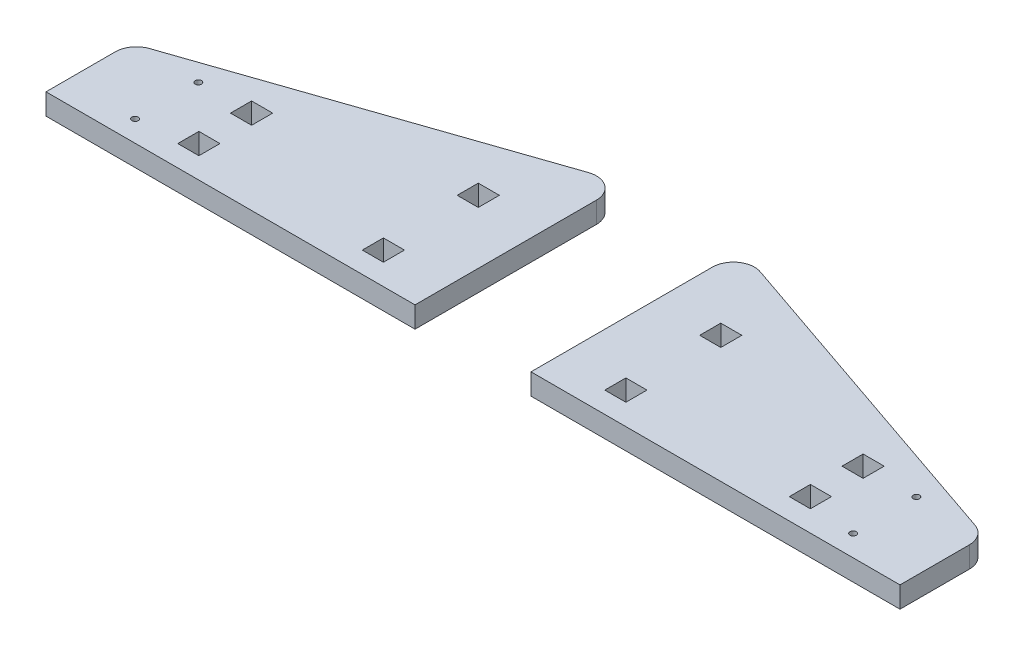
ISO-10303-21;
HEADER;
FILE_DESCRIPTION(('STEP AP214'),'2;1');
FILE_NAME('part.step','',(''),(''),'','','');
FILE_SCHEMA(('AUTOMOTIVE_DESIGN { 1 0 10303 214 1 1 1 1 }'));
ENDSEC;
DATA;
#1=APPLICATION_CONTEXT('core data for automotive mechanical design processes');
#2=APPLICATION_PROTOCOL_DEFINITION('international standard','automotive_design',2000,#1);
#3=PRODUCT_CONTEXT('',#1,'mechanical');
#4=PRODUCT('Part','Part','',(#3));
#5=PRODUCT_RELATED_PRODUCT_CATEGORY('part','',(#4));
#6=PRODUCT_DEFINITION_FORMATION('','',#4);
#7=PRODUCT_DEFINITION_CONTEXT('part definition',#1,'design');
#8=PRODUCT_DEFINITION('design','',#6,#7);
#9=PRODUCT_DEFINITION_SHAPE('','',#8);
#10=(LENGTH_UNIT() NAMED_UNIT(*) SI_UNIT(.MILLI.,.METRE.));
#11=(NAMED_UNIT(*) PLANE_ANGLE_UNIT() SI_UNIT($,.RADIAN.));
#12=(NAMED_UNIT(*) SI_UNIT($,.STERADIAN.) SOLID_ANGLE_UNIT());
#13=UNCERTAINTY_MEASURE_WITH_UNIT(LENGTH_MEASURE(1.E-05),#10,'distance_accuracy_value','');
#14=(GEOMETRIC_REPRESENTATION_CONTEXT(3) GLOBAL_UNCERTAINTY_ASSIGNED_CONTEXT((#13)) GLOBAL_UNIT_ASSIGNED_CONTEXT((#10,
#11,#12)) REPRESENTATION_CONTEXT('',''));
#15=CARTESIAN_POINT('',(0.,0.,0.));
#16=DIRECTION('',(0.,0.,1.));
#17=DIRECTION('',(1.,0.,0.));
#18=AXIS2_PLACEMENT_3D('',#15,#16,#17);
#19=CARTESIAN_POINT('',(0.,20.,0.));
#20=DIRECTION('',(0.,1.,0.));
#21=DIRECTION('',(0.,0.,1.));
#22=AXIS2_PLACEMENT_3D('',#19,#20,#21);
#23=PLANE('',#22);
#24=CARTESIAN_POINT('',(-340.525,20.,-20.));
#25=DIRECTION('',(0.,-1.,0.));
#26=DIRECTION('',(0.,0.,1.));
#27=AXIS2_PLACEMENT_3D('',#24,#25,#26);
#28=CIRCLE('',#27,2.99999999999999);
#29=CARTESIAN_POINT('',(-340.525,20.,-17.));
#30=VERTEX_POINT('',#29);
#31=EDGE_CURVE('E225',#30,#30,#28,.T.);
#32=ORIENTED_EDGE('',*,*,#31,.T.);
#33=EDGE_LOOP('',(#32));
#34=FACE_BOUND('',#33,.T.);
#35=DIRECTION('',(-1.,0.,0.));
#36=VECTOR('',#35,1.);
#37=CARTESIAN_POINT('',(-280.,20.,-20.));
#38=LINE('',#37,#36);
#39=CARTESIAN_POINT('',(-280.,20.,-20.));
#40=VERTEX_POINT('',#39);
#41=CARTESIAN_POINT('',(-300.,20.,-20.));
#42=VERTEX_POINT('',#41);
#43=EDGE_CURVE('E239',#40,#42,#38,.T.);
#44=ORIENTED_EDGE('',*,*,#43,.T.);
#45=DIRECTION('',(0.,0.,-1.));
#46=VECTOR('',#45,1.);
#47=CARTESIAN_POINT('',(-300.,20.,-40.));
#48=LINE('',#47,#46);
#49=CARTESIAN_POINT('',(-300.,20.,-40.));
#50=VERTEX_POINT('',#49);
#51=EDGE_CURVE('E243',#42,#50,#48,.T.);
#52=ORIENTED_EDGE('',*,*,#51,.T.);
#53=DIRECTION('',(1.,0.,0.));
#54=VECTOR('',#53,1.);
#55=CARTESIAN_POINT('',(-280.,20.,-40.));
#56=LINE('',#55,#54);
#57=CARTESIAN_POINT('',(-280.,20.,-40.));
#58=VERTEX_POINT('',#57);
#59=EDGE_CURVE('E246',#50,#58,#56,.T.);
#60=ORIENTED_EDGE('',*,*,#59,.T.);
#61=DIRECTION('',(0.,0.,1.));
#62=VECTOR('',#61,1.);
#63=CARTESIAN_POINT('',(-280.,20.,-40.));
#64=LINE('',#63,#62);
#65=EDGE_CURVE('E236',#58,#40,#64,.T.);
#66=ORIENTED_EDGE('',*,*,#65,.T.);
#67=EDGE_LOOP('',(#44,#52,#60,#66));
#68=FACE_BOUND('',#67,.T.);
#69=DIRECTION('',(-1.,0.,0.));
#70=VECTOR('',#69,1.);
#71=CARTESIAN_POINT('',(-105.,20.,-20.));
#72=LINE('',#71,#70);
#73=CARTESIAN_POINT('',(-105.,20.,-20.));
#74=VERTEX_POINT('',#73);
#75=CARTESIAN_POINT('',(-125.,20.,-20.));
#76=VERTEX_POINT('',#75);
#77=EDGE_CURVE('E303',#74,#76,#72,.T.);
#78=ORIENTED_EDGE('',*,*,#77,.T.);
#79=DIRECTION('',(0.,0.,-1.));
#80=VECTOR('',#79,1.);
#81=CARTESIAN_POINT('',(-125.,20.,-40.));
#82=LINE('',#81,#80);
#83=CARTESIAN_POINT('',(-125.,20.,-40.));
#84=VERTEX_POINT('',#83);
#85=EDGE_CURVE('E307',#76,#84,#82,.T.);
#86=ORIENTED_EDGE('',*,*,#85,.T.);
#87=DIRECTION('',(1.,0.,0.));
#88=VECTOR('',#87,1.);
#89=CARTESIAN_POINT('',(-105.,20.,-40.));
#90=LINE('',#89,#88);
#91=CARTESIAN_POINT('',(-105.,20.,-40.));
#92=VERTEX_POINT('',#91);
#93=EDGE_CURVE('E310',#84,#92,#90,.T.);
#94=ORIENTED_EDGE('',*,*,#93,.T.);
#95=DIRECTION('',(0.,0.,1.));
#96=VECTOR('',#95,1.);
#97=CARTESIAN_POINT('',(-105.,20.,-40.));
#98=LINE('',#97,#96);
#99=EDGE_CURVE('E300',#92,#74,#98,.T.);
#100=ORIENTED_EDGE('',*,*,#99,.T.);
#101=EDGE_LOOP('',(#78,#86,#94,#100));
#102=FACE_BOUND('',#101,.T.);
#103=DIRECTION('',(0.,0.,-1.));
#104=VECTOR('',#103,1.);
#105=CARTESIAN_POINT('',(-405.,20.,0.));
#106=LINE('',#105,#104);
#107=CARTESIAN_POINT('',(-405.,20.,0.));
#108=VERTEX_POINT('',#107);
#109=CARTESIAN_POINT('',(-405.,20.,-65.7142857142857));
#110=VERTEX_POINT('',#109);
#111=EDGE_CURVE('E338',#108,#110,#106,.T.);
#112=ORIENTED_EDGE('',*,*,#111,.F.);
#113=DIRECTION('',(-1.,0.,0.));
#114=VECTOR('',#113,1.);
#115=CARTESIAN_POINT('',(-55.,20.,0.));
#116=LINE('',#115,#114);
#117=CARTESIAN_POINT('',(-55.,20.,0.));
#118=VERTEX_POINT('',#117);
#119=EDGE_CURVE('E334',#118,#108,#116,.T.);
#120=ORIENTED_EDGE('',*,*,#119,.F.);
#121=DIRECTION('',(0.,0.,1.));
#122=VECTOR('',#121,1.);
#123=CARTESIAN_POINT('',(-55.,20.,-200.));
#124=LINE('',#123,#122);
#125=CARTESIAN_POINT('',(-55.,20.,-172.));
#126=VERTEX_POINT('',#125);
#127=EDGE_CURVE('E332',#126,#118,#124,.T.);
#128=ORIENTED_EDGE('',*,*,#127,.F.);
#129=CARTESIAN_POINT('',(-75.,20.,-172.));
#130=DIRECTION('',(0.,-1.,0.));
#131=DIRECTION('',(0.,0.,1.));
#132=AXIS2_PLACEMENT_3D('',#129,#130,#131);
#133=CIRCLE('',#132,20.);
#134=CARTESIAN_POINT('',(-81.4864864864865,20.,-190.918918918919));
#135=VERTEX_POINT('',#134);
#136=EDGE_CURVE('E368',#135,#126,#133,.T.);
#137=ORIENTED_EDGE('',*,*,#136,.F.);
#138=DIRECTION('',(0.945945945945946,0.,-0.324324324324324));
#139=VECTOR('',#138,1.);
#140=CARTESIAN_POINT('',(-405.,20.,-80.));
#141=LINE('',#140,#139);
#142=CARTESIAN_POINT('',(-391.486486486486,20.,-84.6332046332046));
#143=VERTEX_POINT('',#142);
#144=EDGE_CURVE('E341',#143,#135,#141,.T.);
#145=ORIENTED_EDGE('',*,*,#144,.F.);
#146=CARTESIAN_POINT('',(-385.,20.,-65.7142857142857));
#147=DIRECTION('',(0.,-1.,0.));
#148=DIRECTION('',(0.,0.,1.));
#149=AXIS2_PLACEMENT_3D('',#146,#147,#148);
#150=CIRCLE('',#149,20.);
#151=EDGE_CURVE('E50',#110,#143,#150,.T.);
#152=ORIENTED_EDGE('',*,*,#151,.F.);
#153=EDGE_LOOP('',(#112,#120,#128,#137,#145,#152));
#154=FACE_BOUND('',#153,.T.);
#155=DIRECTION('',(-1.,0.,0.));
#156=VECTOR('',#155,1.);
#157=CARTESIAN_POINT('',(-105.,20.,-110.));
#158=LINE('',#157,#156);
#159=CARTESIAN_POINT('',(-105.,20.,-110.));
#160=VERTEX_POINT('',#159);
#161=CARTESIAN_POINT('',(-125.,20.,-110.));
#162=VERTEX_POINT('',#161);
#163=EDGE_CURVE('E271',#160,#162,#158,.T.);
#164=ORIENTED_EDGE('',*,*,#163,.T.);
#165=DIRECTION('',(0.,0.,-1.));
#166=VECTOR('',#165,1.);
#167=CARTESIAN_POINT('',(-125.,20.,-130.));
#168=LINE('',#167,#166);
#169=CARTESIAN_POINT('',(-125.,20.,-130.));
#170=VERTEX_POINT('',#169);
#171=EDGE_CURVE('E275',#162,#170,#168,.T.);
#172=ORIENTED_EDGE('',*,*,#171,.T.);
#173=DIRECTION('',(1.,0.,0.));
#174=VECTOR('',#173,1.);
#175=CARTESIAN_POINT('',(-105.,20.,-130.));
#176=LINE('',#175,#174);
#177=CARTESIAN_POINT('',(-105.,20.,-130.));
#178=VERTEX_POINT('',#177);
#179=EDGE_CURVE('E278',#170,#178,#176,.T.);
#180=ORIENTED_EDGE('',*,*,#179,.T.);
#181=DIRECTION('',(0.,0.,1.));
#182=VECTOR('',#181,1.);
#183=CARTESIAN_POINT('',(-105.,20.,-130.));
#184=LINE('',#183,#182);
#185=EDGE_CURVE('E268',#178,#160,#184,.T.);
#186=ORIENTED_EDGE('',*,*,#185,.T.);
#187=EDGE_LOOP('',(#164,#172,#180,#186));
#188=FACE_BOUND('',#187,.T.);
#189=DIRECTION('',(-1.,0.,0.));
#190=VECTOR('',#189,1.);
#191=CARTESIAN_POINT('',(-280.,20.,-70.));
#192=LINE('',#191,#190);
#193=CARTESIAN_POINT('',(-280.,20.,-70.));
#194=VERTEX_POINT('',#193);
#195=CARTESIAN_POINT('',(-300.,20.,-70.));
#196=VERTEX_POINT('',#195);
#197=EDGE_CURVE('E209',#194,#196,#192,.T.);
#198=ORIENTED_EDGE('',*,*,#197,.T.);
#199=DIRECTION('',(0.,0.,-1.));
#200=VECTOR('',#199,1.);
#201=CARTESIAN_POINT('',(-300.,20.,-90.0000000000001));
#202=LINE('',#201,#200);
#203=CARTESIAN_POINT('',(-300.,20.,-90.0000000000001));
#204=VERTEX_POINT('',#203);
#205=EDGE_CURVE('E216',#196,#204,#202,.T.);
#206=ORIENTED_EDGE('',*,*,#205,.T.);
#207=DIRECTION('',(1.,0.,0.));
#208=VECTOR('',#207,1.);
#209=CARTESIAN_POINT('',(-280.,20.,-90.));
#210=LINE('',#209,#208);
#211=CARTESIAN_POINT('',(-280.,20.,-90.));
#212=VERTEX_POINT('',#211);
#213=EDGE_CURVE('E211',#204,#212,#210,.T.);
#214=ORIENTED_EDGE('',*,*,#213,.T.);
#215=DIRECTION('',(0.,0.,1.));
#216=VECTOR('',#215,1.);
#217=CARTESIAN_POINT('',(-280.,20.,-90.));
#218=LINE('',#217,#216);
#219=EDGE_CURVE('E194',#212,#194,#218,.T.);
#220=ORIENTED_EDGE('',*,*,#219,.T.);
#221=EDGE_LOOP('',(#198,#206,#214,#220));
#222=FACE_BOUND('',#221,.T.);
#223=CARTESIAN_POINT('',(-340.525,20.,-80.));
#224=DIRECTION('',(0.,-1.,0.));
#225=DIRECTION('',(0.,0.,1.));
#226=AXIS2_PLACEMENT_3D('',#223,#224,#225);
#227=CIRCLE('',#226,2.99999999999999);
#228=CARTESIAN_POINT('',(-340.525,20.,-77.));
#229=VERTEX_POINT('',#228);
#230=EDGE_CURVE('E638',#229,#229,#227,.T.);
#231=ORIENTED_EDGE('',*,*,#230,.T.);
#232=EDGE_LOOP('',(#231));
#233=FACE_BOUND('',#232,.T.);
#234=ADVANCED_FACE('F42',(#34,#68,#102,#154,#188,#222,#233),#23,.T.);
#235=CARTESIAN_POINT('',(0.,0.,0.));
#236=DIRECTION('',(0.,1.,0.));
#237=DIRECTION('',(0.,0.,1.));
#238=AXIS2_PLACEMENT_3D('',#235,#236,#237);
#239=PLANE('',#238);
#240=CARTESIAN_POINT('',(-340.525,0.,-20.));
#241=DIRECTION('',(0.,-1.,0.));
#242=DIRECTION('',(0.,0.,1.));
#243=AXIS2_PLACEMENT_3D('',#240,#241,#242);
#244=CIRCLE('',#243,2.99999999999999);
#245=CARTESIAN_POINT('',(-340.525,0.,-17.));
#246=VERTEX_POINT('',#245);
#247=EDGE_CURVE('E644',#246,#246,#244,.T.);
#248=ORIENTED_EDGE('',*,*,#247,.F.);
#249=EDGE_LOOP('',(#248));
#250=FACE_BOUND('',#249,.T.);
#251=DIRECTION('',(0.,0.,1.));
#252=VECTOR('',#251,1.);
#253=CARTESIAN_POINT('',(-280.,0.,-40.));
#254=LINE('',#253,#252);
#255=CARTESIAN_POINT('',(-280.,0.,-40.));
#256=VERTEX_POINT('',#255);
#257=CARTESIAN_POINT('',(-280.,0.,-20.));
#258=VERTEX_POINT('',#257);
#259=EDGE_CURVE('E202',#256,#258,#254,.T.);
#260=ORIENTED_EDGE('',*,*,#259,.F.);
#261=DIRECTION('',(1.,0.,0.));
#262=VECTOR('',#261,1.);
#263=CARTESIAN_POINT('',(-280.,0.,-40.));
#264=LINE('',#263,#262);
#265=CARTESIAN_POINT('',(-300.,0.,-40.));
#266=VERTEX_POINT('',#265);
#267=EDGE_CURVE('E240',#266,#256,#264,.T.);
#268=ORIENTED_EDGE('',*,*,#267,.F.);
#269=DIRECTION('',(0.,0.,-1.));
#270=VECTOR('',#269,1.);
#271=CARTESIAN_POINT('',(-300.,0.,-40.));
#272=LINE('',#271,#270);
#273=CARTESIAN_POINT('',(-300.,0.,-20.));
#274=VERTEX_POINT('',#273);
#275=EDGE_CURVE('E255',#274,#266,#272,.T.);
#276=ORIENTED_EDGE('',*,*,#275,.F.);
#277=DIRECTION('',(-1.,0.,0.));
#278=VECTOR('',#277,1.);
#279=CARTESIAN_POINT('',(-280.,0.,-20.));
#280=LINE('',#279,#278);
#281=EDGE_CURVE('E252',#258,#274,#280,.T.);
#282=ORIENTED_EDGE('',*,*,#281,.F.);
#283=EDGE_LOOP('',(#260,#268,#276,#282));
#284=FACE_BOUND('',#283,.T.);
#285=DIRECTION('',(0.,0.,1.));
#286=VECTOR('',#285,1.);
#287=CARTESIAN_POINT('',(-105.,0.,-40.));
#288=LINE('',#287,#286);
#289=CARTESIAN_POINT('',(-105.,0.,-40.));
#290=VERTEX_POINT('',#289);
#291=CARTESIAN_POINT('',(-105.,0.,-20.));
#292=VERTEX_POINT('',#291);
#293=EDGE_CURVE('E299',#290,#292,#288,.T.);
#294=ORIENTED_EDGE('',*,*,#293,.F.);
#295=DIRECTION('',(1.,0.,0.));
#296=VECTOR('',#295,1.);
#297=CARTESIAN_POINT('',(-105.,0.,-40.));
#298=LINE('',#297,#296);
#299=CARTESIAN_POINT('',(-125.,0.,-40.));
#300=VERTEX_POINT('',#299);
#301=EDGE_CURVE('E304',#300,#290,#298,.T.);
#302=ORIENTED_EDGE('',*,*,#301,.F.);
#303=DIRECTION('',(0.,0.,-1.));
#304=VECTOR('',#303,1.);
#305=CARTESIAN_POINT('',(-125.,0.,-40.));
#306=LINE('',#305,#304);
#307=CARTESIAN_POINT('',(-125.,0.,-20.));
#308=VERTEX_POINT('',#307);
#309=EDGE_CURVE('E319',#308,#300,#306,.T.);
#310=ORIENTED_EDGE('',*,*,#309,.F.);
#311=DIRECTION('',(-1.,0.,0.));
#312=VECTOR('',#311,1.);
#313=CARTESIAN_POINT('',(-105.,0.,-20.));
#314=LINE('',#313,#312);
#315=EDGE_CURVE('E316',#292,#308,#314,.T.);
#316=ORIENTED_EDGE('',*,*,#315,.F.);
#317=EDGE_LOOP('',(#294,#302,#310,#316));
#318=FACE_BOUND('',#317,.T.);
#319=DIRECTION('',(0.945945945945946,0.,-0.324324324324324));
#320=VECTOR('',#319,1.);
#321=CARTESIAN_POINT('',(-405.,0.,-80.));
#322=LINE('',#321,#320);
#323=CARTESIAN_POINT('',(-391.486486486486,0.,-84.6332046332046));
#324=VERTEX_POINT('',#323);
#325=CARTESIAN_POINT('',(-81.4864864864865,0.,-190.918918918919));
#326=VERTEX_POINT('',#325);
#327=EDGE_CURVE('E335',#324,#326,#322,.T.);
#328=ORIENTED_EDGE('',*,*,#327,.T.);
#329=CARTESIAN_POINT('',(-75.,0.,-172.));
#330=DIRECTION('',(0.,-1.,0.));
#331=DIRECTION('',(0.,0.,1.));
#332=AXIS2_PLACEMENT_3D('',#329,#330,#331);
#333=CIRCLE('',#332,20.);
#334=CARTESIAN_POINT('',(-55.,0.,-172.));
#335=VERTEX_POINT('',#334);
#336=EDGE_CURVE('E362',#335,#326,#333,.F.);
#337=ORIENTED_EDGE('',*,*,#336,.F.);
#338=DIRECTION('',(0.,0.,1.));
#339=VECTOR('',#338,1.);
#340=CARTESIAN_POINT('',(-55.,0.,-200.));
#341=LINE('',#340,#339);
#342=CARTESIAN_POINT('',(-55.,0.,0.));
#343=VERTEX_POINT('',#342);
#344=EDGE_CURVE('E331',#335,#343,#341,.T.);
#345=ORIENTED_EDGE('',*,*,#344,.T.);
#346=DIRECTION('',(-1.,0.,0.));
#347=VECTOR('',#346,1.);
#348=CARTESIAN_POINT('',(-55.,0.,0.));
#349=LINE('',#348,#347);
#350=CARTESIAN_POINT('',(-405.,0.,0.));
#351=VERTEX_POINT('',#350);
#352=EDGE_CURVE('E347',#343,#351,#349,.T.);
#353=ORIENTED_EDGE('',*,*,#352,.T.);
#354=DIRECTION('',(0.,0.,-1.));
#355=VECTOR('',#354,1.);
#356=CARTESIAN_POINT('',(-405.,0.,0.));
#357=LINE('',#356,#355);
#358=CARTESIAN_POINT('',(-405.,0.,-65.7142857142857));
#359=VERTEX_POINT('',#358);
#360=EDGE_CURVE('E350',#351,#359,#357,.T.);
#361=ORIENTED_EDGE('',*,*,#360,.T.);
#362=CARTESIAN_POINT('',(-385.,0.,-65.7142857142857));
#363=DIRECTION('',(0.,-1.,0.));
#364=DIRECTION('',(0.,0.,1.));
#365=AXIS2_PLACEMENT_3D('',#362,#363,#364);
#366=CIRCLE('',#365,20.);
#367=EDGE_CURVE('E365',#324,#359,#366,.F.);
#368=ORIENTED_EDGE('',*,*,#367,.F.);
#369=EDGE_LOOP('',(#328,#337,#345,#353,#361,#368));
#370=FACE_BOUND('',#369,.T.);
#371=DIRECTION('',(0.,0.,1.));
#372=VECTOR('',#371,1.);
#373=CARTESIAN_POINT('',(-105.,0.,-130.));
#374=LINE('',#373,#372);
#375=CARTESIAN_POINT('',(-105.,0.,-130.));
#376=VERTEX_POINT('',#375);
#377=CARTESIAN_POINT('',(-105.,0.,-110.));
#378=VERTEX_POINT('',#377);
#379=EDGE_CURVE('E267',#376,#378,#374,.T.);
#380=ORIENTED_EDGE('',*,*,#379,.F.);
#381=DIRECTION('',(1.,0.,0.));
#382=VECTOR('',#381,1.);
#383=CARTESIAN_POINT('',(-105.,0.,-130.));
#384=LINE('',#383,#382);
#385=CARTESIAN_POINT('',(-125.,0.,-130.));
#386=VERTEX_POINT('',#385);
#387=EDGE_CURVE('E272',#386,#376,#384,.T.);
#388=ORIENTED_EDGE('',*,*,#387,.F.);
#389=DIRECTION('',(0.,0.,-1.));
#390=VECTOR('',#389,1.);
#391=CARTESIAN_POINT('',(-125.,0.,-130.));
#392=LINE('',#391,#390);
#393=CARTESIAN_POINT('',(-125.,0.,-110.));
#394=VERTEX_POINT('',#393);
#395=EDGE_CURVE('E287',#394,#386,#392,.T.);
#396=ORIENTED_EDGE('',*,*,#395,.F.);
#397=DIRECTION('',(-1.,0.,0.));
#398=VECTOR('',#397,1.);
#399=CARTESIAN_POINT('',(-105.,0.,-110.));
#400=LINE('',#399,#398);
#401=EDGE_CURVE('E284',#378,#394,#400,.T.);
#402=ORIENTED_EDGE('',*,*,#401,.F.);
#403=EDGE_LOOP('',(#380,#388,#396,#402));
#404=FACE_BOUND('',#403,.T.);
#405=DIRECTION('',(0.,0.,1.));
#406=VECTOR('',#405,1.);
#407=CARTESIAN_POINT('',(-280.,0.,-90.));
#408=LINE('',#407,#406);
#409=CARTESIAN_POINT('',(-280.,0.,-90.));
#410=VERTEX_POINT('',#409);
#411=CARTESIAN_POINT('',(-280.,0.,-70.));
#412=VERTEX_POINT('',#411);
#413=EDGE_CURVE('E197',#410,#412,#408,.T.);
#414=ORIENTED_EDGE('',*,*,#413,.F.);
#415=DIRECTION('',(1.,0.,0.));
#416=VECTOR('',#415,1.);
#417=CARTESIAN_POINT('',(-280.,0.,-90.));
#418=LINE('',#417,#416);
#419=CARTESIAN_POINT('',(-300.,0.,-90.0000000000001));
#420=VERTEX_POINT('',#419);
#421=EDGE_CURVE('E212',#420,#410,#418,.T.);
#422=ORIENTED_EDGE('',*,*,#421,.F.);
#423=DIRECTION('',(0.,0.,-1.));
#424=VECTOR('',#423,1.);
#425=CARTESIAN_POINT('',(-300.,0.,-90.0000000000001));
#426=LINE('',#425,#424);
#427=CARTESIAN_POINT('',(-300.,0.,-70.));
#428=VERTEX_POINT('',#427);
#429=EDGE_CURVE('E227',#428,#420,#426,.T.);
#430=ORIENTED_EDGE('',*,*,#429,.F.);
#431=DIRECTION('',(-1.,0.,0.));
#432=VECTOR('',#431,1.);
#433=CARTESIAN_POINT('',(-280.,0.,-70.));
#434=LINE('',#433,#432);
#435=EDGE_CURVE('E224',#412,#428,#434,.T.);
#436=ORIENTED_EDGE('',*,*,#435,.F.);
#437=EDGE_LOOP('',(#414,#422,#430,#436));
#438=FACE_BOUND('',#437,.T.);
#439=CARTESIAN_POINT('',(-340.525,0.,-80.));
#440=DIRECTION('',(0.,-1.,0.));
#441=DIRECTION('',(0.,0.,1.));
#442=AXIS2_PLACEMENT_3D('',#439,#440,#441);
#443=CIRCLE('',#442,2.99999999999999);
#444=CARTESIAN_POINT('',(-340.525,0.,-77.));
#445=VERTEX_POINT('',#444);
#446=EDGE_CURVE('E641',#445,#445,#443,.T.);
#447=ORIENTED_EDGE('',*,*,#446,.F.);
#448=EDGE_LOOP('',(#447));
#449=FACE_BOUND('',#448,.T.);
#450=ADVANCED_FACE('F382',(#250,#284,#318,#370,#404,#438,#449),#239,.F.);
#451=CARTESIAN_POINT('',(-55.,20.,-200.));
#452=DIRECTION('',(-1.,0.,0.));
#453=DIRECTION('',(0.,0.,-1.));
#454=AXIS2_PLACEMENT_3D('',#451,#452,#453);
#455=PLANE('',#454);
#456=ORIENTED_EDGE('',*,*,#127,.T.);
#457=DIRECTION('',(0.,-1.,0.));
#458=VECTOR('',#457,1.);
#459=CARTESIAN_POINT('',(-55.,20.,0.));
#460=LINE('',#459,#458);
#461=EDGE_CURVE('E356',#118,#343,#460,.T.);
#462=ORIENTED_EDGE('',*,*,#461,.T.);
#463=ORIENTED_EDGE('',*,*,#344,.F.);
#464=DIRECTION('',(0.,-1.,0.));
#465=VECTOR('',#464,1.);
#466=CARTESIAN_POINT('',(-55.,20.,-172.));
#467=LINE('',#466,#465);
#468=EDGE_CURVE('E12',#126,#335,#467,.T.);
#469=ORIENTED_EDGE('',*,*,#468,.F.);
#470=EDGE_LOOP('',(#456,#462,#463,#469));
#471=FACE_BOUND('',#470,.T.);
#472=ADVANCED_FACE('F391',(#471),#455,.F.);
#473=CARTESIAN_POINT('',(-55.,20.,0.));
#474=DIRECTION('',(0.,0.,-1.));
#475=DIRECTION('',(1.,0.,0.));
#476=AXIS2_PLACEMENT_3D('',#473,#474,#475);
#477=PLANE('',#476);
#478=ORIENTED_EDGE('',*,*,#352,.F.);
#479=ORIENTED_EDGE('',*,*,#461,.F.);
#480=ORIENTED_EDGE('',*,*,#119,.T.);
#481=DIRECTION('',(0.,-1.,0.));
#482=VECTOR('',#481,1.);
#483=CARTESIAN_POINT('',(-405.,20.,0.));
#484=LINE('',#483,#482);
#485=EDGE_CURVE('E344',#108,#351,#484,.T.);
#486=ORIENTED_EDGE('',*,*,#485,.T.);
#487=EDGE_LOOP('',(#478,#479,#480,#486));
#488=FACE_BOUND('',#487,.T.);
#489=ADVANCED_FACE('F390',(#488),#477,.F.);
#490=CARTESIAN_POINT('',(-405.,20.,0.));
#491=DIRECTION('',(1.,0.,0.));
#492=DIRECTION('',(0.,0.,1.));
#493=AXIS2_PLACEMENT_3D('',#490,#491,#492);
#494=PLANE('',#493);
#495=ORIENTED_EDGE('',*,*,#360,.F.);
#496=ORIENTED_EDGE('',*,*,#485,.F.);
#497=ORIENTED_EDGE('',*,*,#111,.T.);
#498=DIRECTION('',(0.,-1.,0.));
#499=VECTOR('',#498,1.);
#500=CARTESIAN_POINT('',(-405.,20.,-65.7142857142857));
#501=LINE('',#500,#499);
#502=EDGE_CURVE('E63',#359,#110,#501,.F.);
#503=ORIENTED_EDGE('',*,*,#502,.F.);
#504=EDGE_LOOP('',(#495,#496,#497,#503));
#505=FACE_BOUND('',#504,.T.);
#506=ADVANCED_FACE('F387',(#505),#494,.F.);
#507=CARTESIAN_POINT('',(-405.,20.,-80.));
#508=DIRECTION('',(0.324324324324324,0.,0.945945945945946));
#509=DIRECTION('',(-0.945945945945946,0.,0.324324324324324));
#510=AXIS2_PLACEMENT_3D('',#507,#508,#509);
#511=PLANE('',#510);
#512=ORIENTED_EDGE('',*,*,#144,.T.);
#513=DIRECTION('',(0.,-1.,0.));
#514=VECTOR('',#513,1.);
#515=CARTESIAN_POINT('',(-81.4864864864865,20.,-190.918918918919));
#516=LINE('',#515,#514);
#517=EDGE_CURVE('E358',#326,#135,#516,.F.);
#518=ORIENTED_EDGE('',*,*,#517,.F.);
#519=ORIENTED_EDGE('',*,*,#327,.F.);
#520=DIRECTION('',(0.,-1.,0.));
#521=VECTOR('',#520,1.);
#522=CARTESIAN_POINT('',(-391.486486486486,20.,-84.6332046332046));
#523=LINE('',#522,#521);
#524=EDGE_CURVE('E360',#143,#324,#523,.T.);
#525=ORIENTED_EDGE('',*,*,#524,.F.);
#526=EDGE_LOOP('',(#512,#518,#519,#525));
#527=FACE_BOUND('',#526,.T.);
#528=ADVANCED_FACE('F378',(#527),#511,.F.);
#529=CARTESIAN_POINT('',(-105.,20.,-40.));
#530=DIRECTION('',(-1.,0.,0.));
#531=DIRECTION('',(0.,0.,-1.));
#532=AXIS2_PLACEMENT_3D('',#529,#530,#531);
#533=PLANE('',#532);
#534=ORIENTED_EDGE('',*,*,#293,.T.);
#535=DIRECTION('',(0.,-1.,0.));
#536=VECTOR('',#535,1.);
#537=CARTESIAN_POINT('',(-105.,20.,-20.));
#538=LINE('',#537,#536);
#539=EDGE_CURVE('E329',#74,#292,#538,.T.);
#540=ORIENTED_EDGE('',*,*,#539,.F.);
#541=ORIENTED_EDGE('',*,*,#99,.F.);
#542=DIRECTION('',(0.,-1.,0.));
#543=VECTOR('',#542,1.);
#544=CARTESIAN_POINT('',(-105.,20.,-40.));
#545=LINE('',#544,#543);
#546=EDGE_CURVE('E313',#92,#290,#545,.T.);
#547=ORIENTED_EDGE('',*,*,#546,.T.);
#548=EDGE_LOOP('',(#534,#540,#541,#547));
#549=FACE_BOUND('',#548,.T.);
#550=ADVANCED_FACE('F409',(#549),#533,.T.);
#551=CARTESIAN_POINT('',(-105.,20.,-20.));
#552=DIRECTION('',(0.,0.,-1.));
#553=DIRECTION('',(1.,0.,0.));
#554=AXIS2_PLACEMENT_3D('',#551,#552,#553);
#555=PLANE('',#554);
#556=ORIENTED_EDGE('',*,*,#315,.T.);
#557=DIRECTION('',(0.,-1.,0.));
#558=VECTOR('',#557,1.);
#559=CARTESIAN_POINT('',(-125.,20.,-20.));
#560=LINE('',#559,#558);
#561=EDGE_CURVE('E327',#76,#308,#560,.T.);
#562=ORIENTED_EDGE('',*,*,#561,.F.);
#563=ORIENTED_EDGE('',*,*,#77,.F.);
#564=ORIENTED_EDGE('',*,*,#539,.T.);
#565=EDGE_LOOP('',(#556,#562,#563,#564));
#566=FACE_BOUND('',#565,.T.);
#567=ADVANCED_FACE('F429',(#566),#555,.T.);
#568=CARTESIAN_POINT('',(-125.,20.,-40.));
#569=DIRECTION('',(1.,0.,0.));
#570=DIRECTION('',(0.,0.,1.));
#571=AXIS2_PLACEMENT_3D('',#568,#569,#570);
#572=PLANE('',#571);
#573=ORIENTED_EDGE('',*,*,#309,.T.);
#574=DIRECTION('',(0.,-1.,0.));
#575=VECTOR('',#574,1.);
#576=CARTESIAN_POINT('',(-125.,20.,-40.));
#577=LINE('',#576,#575);
#578=EDGE_CURVE('E325',#84,#300,#577,.T.);
#579=ORIENTED_EDGE('',*,*,#578,.F.);
#580=ORIENTED_EDGE('',*,*,#85,.F.);
#581=ORIENTED_EDGE('',*,*,#561,.T.);
#582=EDGE_LOOP('',(#573,#579,#580,#581));
#583=FACE_BOUND('',#582,.T.);
#584=ADVANCED_FACE('F436',(#583),#572,.T.);
#585=CARTESIAN_POINT('',(-105.,20.,-40.));
#586=DIRECTION('',(0.,0.,1.));
#587=DIRECTION('',(-1.,0.,0.));
#588=AXIS2_PLACEMENT_3D('',#585,#586,#587);
#589=PLANE('',#588);
#590=ORIENTED_EDGE('',*,*,#301,.T.);
#591=ORIENTED_EDGE('',*,*,#546,.F.);
#592=ORIENTED_EDGE('',*,*,#93,.F.);
#593=ORIENTED_EDGE('',*,*,#578,.T.);
#594=EDGE_LOOP('',(#590,#591,#592,#593));
#595=FACE_BOUND('',#594,.T.);
#596=ADVANCED_FACE('F443',(#595),#589,.T.);
#597=CARTESIAN_POINT('',(-105.,20.,-130.));
#598=DIRECTION('',(-1.,0.,0.));
#599=DIRECTION('',(0.,0.,-1.));
#600=AXIS2_PLACEMENT_3D('',#597,#598,#599);
#601=PLANE('',#600);
#602=ORIENTED_EDGE('',*,*,#379,.T.);
#603=DIRECTION('',(0.,-1.,0.));
#604=VECTOR('',#603,1.);
#605=CARTESIAN_POINT('',(-105.,20.,-110.));
#606=LINE('',#605,#604);
#607=EDGE_CURVE('E297',#160,#378,#606,.T.);
#608=ORIENTED_EDGE('',*,*,#607,.F.);
#609=ORIENTED_EDGE('',*,*,#185,.F.);
#610=DIRECTION('',(0.,-1.,0.));
#611=VECTOR('',#610,1.);
#612=CARTESIAN_POINT('',(-105.,20.,-130.));
#613=LINE('',#612,#611);
#614=EDGE_CURVE('E281',#178,#376,#613,.T.);
#615=ORIENTED_EDGE('',*,*,#614,.T.);
#616=EDGE_LOOP('',(#602,#608,#609,#615));
#617=FACE_BOUND('',#616,.T.);
#618=ADVANCED_FACE('F451',(#617),#601,.T.);
#619=CARTESIAN_POINT('',(-105.,20.,-110.));
#620=DIRECTION('',(0.,0.,-1.));
#621=DIRECTION('',(1.,0.,0.));
#622=AXIS2_PLACEMENT_3D('',#619,#620,#621);
#623=PLANE('',#622);
#624=ORIENTED_EDGE('',*,*,#401,.T.);
#625=DIRECTION('',(0.,-1.,0.));
#626=VECTOR('',#625,1.);
#627=CARTESIAN_POINT('',(-125.,20.,-110.));
#628=LINE('',#627,#626);
#629=EDGE_CURVE('E295',#162,#394,#628,.T.);
#630=ORIENTED_EDGE('',*,*,#629,.F.);
#631=ORIENTED_EDGE('',*,*,#163,.F.);
#632=ORIENTED_EDGE('',*,*,#607,.T.);
#633=EDGE_LOOP('',(#624,#630,#631,#632));
#634=FACE_BOUND('',#633,.T.);
#635=ADVANCED_FACE('F459',(#634),#623,.T.);
#636=CARTESIAN_POINT('',(-125.,20.,-130.));
#637=DIRECTION('',(1.,0.,0.));
#638=DIRECTION('',(0.,0.,1.));
#639=AXIS2_PLACEMENT_3D('',#636,#637,#638);
#640=PLANE('',#639);
#641=ORIENTED_EDGE('',*,*,#395,.T.);
#642=DIRECTION('',(0.,-1.,0.));
#643=VECTOR('',#642,1.);
#644=CARTESIAN_POINT('',(-125.,20.,-130.));
#645=LINE('',#644,#643);
#646=EDGE_CURVE('E293',#170,#386,#645,.T.);
#647=ORIENTED_EDGE('',*,*,#646,.F.);
#648=ORIENTED_EDGE('',*,*,#171,.F.);
#649=ORIENTED_EDGE('',*,*,#629,.T.);
#650=EDGE_LOOP('',(#641,#647,#648,#649));
#651=FACE_BOUND('',#650,.T.);
#652=ADVANCED_FACE('F467',(#651),#640,.T.);
#653=CARTESIAN_POINT('',(-105.,20.,-130.));
#654=DIRECTION('',(0.,0.,1.));
#655=DIRECTION('',(-1.,0.,0.));
#656=AXIS2_PLACEMENT_3D('',#653,#654,#655);
#657=PLANE('',#656);
#658=ORIENTED_EDGE('',*,*,#387,.T.);
#659=ORIENTED_EDGE('',*,*,#614,.F.);
#660=ORIENTED_EDGE('',*,*,#179,.F.);
#661=ORIENTED_EDGE('',*,*,#646,.T.);
#662=EDGE_LOOP('',(#658,#659,#660,#661));
#663=FACE_BOUND('',#662,.T.);
#664=ADVANCED_FACE('F475',(#663),#657,.T.);
#665=CARTESIAN_POINT('',(-280.,20.,-40.));
#666=DIRECTION('',(-1.,0.,0.));
#667=DIRECTION('',(0.,0.,-1.));
#668=AXIS2_PLACEMENT_3D('',#665,#666,#667);
#669=PLANE('',#668);
#670=ORIENTED_EDGE('',*,*,#259,.T.);
#671=DIRECTION('',(0.,-1.,0.));
#672=VECTOR('',#671,1.);
#673=CARTESIAN_POINT('',(-280.,20.,-20.));
#674=LINE('',#673,#672);
#675=EDGE_CURVE('E265',#40,#258,#674,.T.);
#676=ORIENTED_EDGE('',*,*,#675,.F.);
#677=ORIENTED_EDGE('',*,*,#65,.F.);
#678=DIRECTION('',(0.,-1.,0.));
#679=VECTOR('',#678,1.);
#680=CARTESIAN_POINT('',(-280.,20.,-40.));
#681=LINE('',#680,#679);
#682=EDGE_CURVE('E249',#58,#256,#681,.T.);
#683=ORIENTED_EDGE('',*,*,#682,.T.);
#684=EDGE_LOOP('',(#670,#676,#677,#683));
#685=FACE_BOUND('',#684,.T.);
#686=ADVANCED_FACE('F483',(#685),#669,.T.);
#687=CARTESIAN_POINT('',(-280.,20.,-20.));
#688=DIRECTION('',(0.,0.,-1.));
#689=DIRECTION('',(1.,0.,0.));
#690=AXIS2_PLACEMENT_3D('',#687,#688,#689);
#691=PLANE('',#690);
#692=ORIENTED_EDGE('',*,*,#281,.T.);
#693=DIRECTION('',(0.,-1.,0.));
#694=VECTOR('',#693,1.);
#695=CARTESIAN_POINT('',(-300.,20.,-20.));
#696=LINE('',#695,#694);
#697=EDGE_CURVE('E263',#42,#274,#696,.T.);
#698=ORIENTED_EDGE('',*,*,#697,.F.);
#699=ORIENTED_EDGE('',*,*,#43,.F.);
#700=ORIENTED_EDGE('',*,*,#675,.T.);
#701=EDGE_LOOP('',(#692,#698,#699,#700));
#702=FACE_BOUND('',#701,.T.);
#703=ADVANCED_FACE('F491',(#702),#691,.T.);
#704=CARTESIAN_POINT('',(-300.,20.,-40.));
#705=DIRECTION('',(1.,0.,0.));
#706=DIRECTION('',(0.,0.,1.));
#707=AXIS2_PLACEMENT_3D('',#704,#705,#706);
#708=PLANE('',#707);
#709=ORIENTED_EDGE('',*,*,#275,.T.);
#710=DIRECTION('',(0.,-1.,0.));
#711=VECTOR('',#710,1.);
#712=CARTESIAN_POINT('',(-300.,20.,-40.));
#713=LINE('',#712,#711);
#714=EDGE_CURVE('E261',#50,#266,#713,.T.);
#715=ORIENTED_EDGE('',*,*,#714,.F.);
#716=ORIENTED_EDGE('',*,*,#51,.F.);
#717=ORIENTED_EDGE('',*,*,#697,.T.);
#718=EDGE_LOOP('',(#709,#715,#716,#717));
#719=FACE_BOUND('',#718,.T.);
#720=ADVANCED_FACE('F499',(#719),#708,.T.);
#721=CARTESIAN_POINT('',(-280.,20.,-40.));
#722=DIRECTION('',(0.,0.,1.));
#723=DIRECTION('',(-1.,0.,0.));
#724=AXIS2_PLACEMENT_3D('',#721,#722,#723);
#725=PLANE('',#724);
#726=ORIENTED_EDGE('',*,*,#267,.T.);
#727=ORIENTED_EDGE('',*,*,#682,.F.);
#728=ORIENTED_EDGE('',*,*,#59,.F.);
#729=ORIENTED_EDGE('',*,*,#714,.T.);
#730=EDGE_LOOP('',(#726,#727,#728,#729));
#731=FACE_BOUND('',#730,.T.);
#732=ADVANCED_FACE('F507',(#731),#725,.T.);
#733=CARTESIAN_POINT('',(-280.,20.,-90.));
#734=DIRECTION('',(-1.,0.,0.));
#735=DIRECTION('',(0.,0.,-1.));
#736=AXIS2_PLACEMENT_3D('',#733,#734,#735);
#737=PLANE('',#736);
#738=ORIENTED_EDGE('',*,*,#413,.T.);
#739=DIRECTION('',(0.,-1.,0.));
#740=VECTOR('',#739,1.);
#741=CARTESIAN_POINT('',(-280.,20.,-70.));
#742=LINE('',#741,#740);
#743=EDGE_CURVE('E191',#194,#412,#742,.T.);
#744=ORIENTED_EDGE('',*,*,#743,.F.);
#745=ORIENTED_EDGE('',*,*,#219,.F.);
#746=DIRECTION('',(0.,-1.,0.));
#747=VECTOR('',#746,1.);
#748=CARTESIAN_POINT('',(-280.,20.,-90.));
#749=LINE('',#748,#747);
#750=EDGE_CURVE('E222',#212,#410,#749,.T.);
#751=ORIENTED_EDGE('',*,*,#750,.T.);
#752=EDGE_LOOP('',(#738,#744,#745,#751));
#753=FACE_BOUND('',#752,.T.);
#754=ADVANCED_FACE('F193',(#753),#737,.T.);
#755=CARTESIAN_POINT('',(-280.,20.,-70.));
#756=DIRECTION('',(0.,0.,-1.));
#757=DIRECTION('',(1.,0.,0.));
#758=AXIS2_PLACEMENT_3D('',#755,#756,#757);
#759=PLANE('',#758);
#760=ORIENTED_EDGE('',*,*,#435,.T.);
#761=DIRECTION('',(0.,-1.,0.));
#762=VECTOR('',#761,1.);
#763=CARTESIAN_POINT('',(-300.,20.,-70.));
#764=LINE('',#763,#762);
#765=EDGE_CURVE('E203',#196,#428,#764,.T.);
#766=ORIENTED_EDGE('',*,*,#765,.F.);
#767=ORIENTED_EDGE('',*,*,#197,.F.);
#768=ORIENTED_EDGE('',*,*,#743,.T.);
#769=EDGE_LOOP('',(#760,#766,#767,#768));
#770=FACE_BOUND('',#769,.T.);
#771=ADVANCED_FACE('F214',(#770),#759,.T.);
#772=CARTESIAN_POINT('',(-300.,20.,-90.0000000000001));
#773=DIRECTION('',(1.,0.,0.));
#774=DIRECTION('',(0.,0.,1.));
#775=AXIS2_PLACEMENT_3D('',#772,#773,#774);
#776=PLANE('',#775);
#777=ORIENTED_EDGE('',*,*,#429,.T.);
#778=DIRECTION('',(0.,-1.,0.));
#779=VECTOR('',#778,1.);
#780=CARTESIAN_POINT('',(-300.,20.,-90.0000000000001));
#781=LINE('',#780,#779);
#782=EDGE_CURVE('E233',#204,#420,#781,.T.);
#783=ORIENTED_EDGE('',*,*,#782,.F.);
#784=ORIENTED_EDGE('',*,*,#205,.F.);
#785=ORIENTED_EDGE('',*,*,#765,.T.);
#786=EDGE_LOOP('',(#777,#783,#784,#785));
#787=FACE_BOUND('',#786,.T.);
#788=ADVANCED_FACE('F528',(#787),#776,.T.);
#789=CARTESIAN_POINT('',(-280.,20.,-90.));
#790=DIRECTION('',(0.,0.,1.));
#791=DIRECTION('',(-1.,0.,0.));
#792=AXIS2_PLACEMENT_3D('',#789,#790,#791);
#793=PLANE('',#792);
#794=ORIENTED_EDGE('',*,*,#421,.T.);
#795=ORIENTED_EDGE('',*,*,#750,.F.);
#796=ORIENTED_EDGE('',*,*,#213,.F.);
#797=ORIENTED_EDGE('',*,*,#782,.T.);
#798=EDGE_LOOP('',(#794,#795,#796,#797));
#799=FACE_BOUND('',#798,.T.);
#800=ADVANCED_FACE('F535',(#799),#793,.T.);
#801=CARTESIAN_POINT('',(-340.525,20.,-20.));
#802=DIRECTION('',(0.,-1.,0.));
#803=DIRECTION('',(0.,0.,-1.));
#804=AXIS2_PLACEMENT_3D('',#801,#802,#803);
#805=CYLINDRICAL_SURFACE('',#804,2.99999999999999);
#806=ORIENTED_EDGE('',*,*,#31,.F.);
#807=EDGE_LOOP('',(#806));
#808=FACE_BOUND('',#807,.T.);
#809=ORIENTED_EDGE('',*,*,#247,.T.);
#810=EDGE_LOOP('',(#809));
#811=FACE_BOUND('',#810,.T.);
#812=ADVANCED_FACE('F543',(#808,#811),#805,.F.);
#813=CARTESIAN_POINT('',(-340.525,20.,-80.));
#814=DIRECTION('',(0.,-1.,0.));
#815=DIRECTION('',(0.,0.,-1.));
#816=AXIS2_PLACEMENT_3D('',#813,#814,#815);
#817=CYLINDRICAL_SURFACE('',#816,2.99999999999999);
#818=ORIENTED_EDGE('',*,*,#230,.F.);
#819=EDGE_LOOP('',(#818));
#820=FACE_BOUND('',#819,.T.);
#821=ORIENTED_EDGE('',*,*,#446,.T.);
#822=EDGE_LOOP('',(#821));
#823=FACE_BOUND('',#822,.T.);
#824=ADVANCED_FACE('F551',(#820,#823),#817,.F.);
#825=CARTESIAN_POINT('',(-385.,20.,-65.7142857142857));
#826=DIRECTION('',(0.,-1.,0.));
#827=DIRECTION('',(0.,0.,-1.));
#828=AXIS2_PLACEMENT_3D('',#825,#826,#827);
#829=CYLINDRICAL_SURFACE('',#828,20.);
#830=ORIENTED_EDGE('',*,*,#151,.T.);
#831=ORIENTED_EDGE('',*,*,#524,.T.);
#832=ORIENTED_EDGE('',*,*,#367,.T.);
#833=ORIENTED_EDGE('',*,*,#502,.T.);
#834=EDGE_LOOP('',(#830,#831,#832,#833));
#835=FACE_BOUND('',#834,.T.);
#836=ADVANCED_FACE('F370',(#835),#829,.T.);
#837=CARTESIAN_POINT('',(-75.,20.,-172.));
#838=DIRECTION('',(0.,-1.,0.));
#839=DIRECTION('',(0.,0.,-1.));
#840=AXIS2_PLACEMENT_3D('',#837,#838,#839);
#841=CYLINDRICAL_SURFACE('',#840,20.);
#842=ORIENTED_EDGE('',*,*,#136,.T.);
#843=ORIENTED_EDGE('',*,*,#468,.T.);
#844=ORIENTED_EDGE('',*,*,#336,.T.);
#845=ORIENTED_EDGE('',*,*,#517,.T.);
#846=EDGE_LOOP('',(#842,#843,#844,#845));
#847=FACE_BOUND('',#846,.T.);
#848=ADVANCED_FACE('F44',(#847),#841,.T.);
#849=CLOSED_SHELL('',(#234,#450,#472,#489,#506,#528,#550,#567,#584,#596,#618,#635,#652,#664,
#686,#703,#720,#732,#754,#771,#788,#800,#812,#824,#836,#848));
#850=MANIFOLD_SOLID_BREP('B2',#849);
#851=CARTESIAN_POINT('',(0.,20.,0.));
#852=DIRECTION('',(0.,1.,0.));
#853=DIRECTION('',(0.,0.,1.));
#854=AXIS2_PLACEMENT_3D('',#851,#852,#853);
#855=PLANE('',#854);
#856=CARTESIAN_POINT('',(340.525,20.,-20.));
#857=DIRECTION('',(0.,1.,0.));
#858=DIRECTION('',(0.,0.,1.));
#859=AXIS2_PLACEMENT_3D('',#856,#857,#858);
#860=CIRCLE('',#859,2.99999999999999);
#861=CARTESIAN_POINT('',(340.525,20.,-17.));
#862=VERTEX_POINT('',#861);
#863=EDGE_CURVE('E869',#862,#862,#860,.T.);
#864=ORIENTED_EDGE('',*,*,#863,.F.);
#865=EDGE_LOOP('',(#864));
#866=FACE_BOUND('',#865,.T.);
#867=DIRECTION('',(1.,0.,0.));
#868=VECTOR('',#867,1.);
#869=CARTESIAN_POINT('',(280.,20.,-20.));
#870=LINE('',#869,#868);
#871=CARTESIAN_POINT('',(280.,20.,-20.));
#872=VERTEX_POINT('',#871);
#873=CARTESIAN_POINT('',(300.,20.,-20.));
#874=VERTEX_POINT('',#873);
#875=EDGE_CURVE('E882',#872,#874,#870,.T.);
#876=ORIENTED_EDGE('',*,*,#875,.F.);
#877=DIRECTION('',(0.,0.,1.));
#878=VECTOR('',#877,1.);
#879=CARTESIAN_POINT('',(280.,20.,-40.));
#880=LINE('',#879,#878);
#881=CARTESIAN_POINT('',(280.,20.,-40.));
#882=VERTEX_POINT('',#881);
#883=EDGE_CURVE('E880',#882,#872,#880,.T.);
#884=ORIENTED_EDGE('',*,*,#883,.F.);
#885=DIRECTION('',(-1.,0.,0.));
#886=VECTOR('',#885,1.);
#887=CARTESIAN_POINT('',(280.,20.,-40.));
#888=LINE('',#887,#886);
#889=CARTESIAN_POINT('',(300.,20.,-40.));
#890=VERTEX_POINT('',#889);
#891=EDGE_CURVE('E888',#890,#882,#888,.T.);
#892=ORIENTED_EDGE('',*,*,#891,.F.);
#893=DIRECTION('',(0.,0.,-1.));
#894=VECTOR('',#893,1.);
#895=CARTESIAN_POINT('',(300.,20.,-40.));
#896=LINE('',#895,#894);
#897=EDGE_CURVE('E885',#874,#890,#896,.T.);
#898=ORIENTED_EDGE('',*,*,#897,.F.);
#899=EDGE_LOOP('',(#876,#884,#892,#898));
#900=FACE_BOUND('',#899,.T.);
#901=DIRECTION('',(1.,0.,0.));
#902=VECTOR('',#901,1.);
#903=CARTESIAN_POINT('',(105.,20.,-20.));
#904=LINE('',#903,#902);
#905=CARTESIAN_POINT('',(105.,20.,-20.));
#906=VERTEX_POINT('',#905);
#907=CARTESIAN_POINT('',(125.,20.,-20.));
#908=VERTEX_POINT('',#907);
#909=EDGE_CURVE('E944',#906,#908,#904,.T.);
#910=ORIENTED_EDGE('',*,*,#909,.F.);
#911=DIRECTION('',(0.,0.,1.));
#912=VECTOR('',#911,1.);
#913=CARTESIAN_POINT('',(105.,20.,-40.));
#914=LINE('',#913,#912);
#915=CARTESIAN_POINT('',(105.,20.,-40.));
#916=VERTEX_POINT('',#915);
#917=EDGE_CURVE('E942',#916,#906,#914,.T.);
#918=ORIENTED_EDGE('',*,*,#917,.F.);
#919=DIRECTION('',(-1.,0.,0.));
#920=VECTOR('',#919,1.);
#921=CARTESIAN_POINT('',(105.,20.,-40.));
#922=LINE('',#921,#920);
#923=CARTESIAN_POINT('',(125.,20.,-40.));
#924=VERTEX_POINT('',#923);
#925=EDGE_CURVE('E950',#924,#916,#922,.T.);
#926=ORIENTED_EDGE('',*,*,#925,.F.);
#927=DIRECTION('',(0.,0.,-1.));
#928=VECTOR('',#927,1.);
#929=CARTESIAN_POINT('',(125.,20.,-40.));
#930=LINE('',#929,#928);
#931=EDGE_CURVE('E947',#908,#924,#930,.T.);
#932=ORIENTED_EDGE('',*,*,#931,.F.);
#933=EDGE_LOOP('',(#910,#918,#926,#932));
#934=FACE_BOUND('',#933,.T.);
#935=DIRECTION('',(0.,0.,-1.));
#936=VECTOR('',#935,1.);
#937=CARTESIAN_POINT('',(405.,20.,0.));
#938=LINE('',#937,#936);
#939=CARTESIAN_POINT('',(405.,20.,0.));
#940=VERTEX_POINT('',#939);
#941=CARTESIAN_POINT('',(405.,20.,-65.7142857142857));
#942=VERTEX_POINT('',#941);
#943=EDGE_CURVE('E978',#940,#942,#938,.T.);
#944=ORIENTED_EDGE('',*,*,#943,.T.);
#945=CARTESIAN_POINT('',(385.,20.,-65.7142857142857));
#946=DIRECTION('',(0.,1.,0.));
#947=DIRECTION('',(0.,0.,1.));
#948=AXIS2_PLACEMENT_3D('',#945,#946,#947);
#949=CIRCLE('',#948,20.);
#950=CARTESIAN_POINT('',(391.486486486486,20.,-84.6332046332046));
#951=VERTEX_POINT('',#950);
#952=EDGE_CURVE('E691',#942,#951,#949,.T.);
#953=ORIENTED_EDGE('',*,*,#952,.T.);
#954=DIRECTION('',(-0.945945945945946,0.,-0.324324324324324));
#955=VECTOR('',#954,1.);
#956=CARTESIAN_POINT('',(405.,20.,-80.));
#957=LINE('',#956,#955);
#958=CARTESIAN_POINT('',(81.4864864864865,20.,-190.918918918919));
#959=VERTEX_POINT('',#958);
#960=EDGE_CURVE('E980',#951,#959,#957,.T.);
#961=ORIENTED_EDGE('',*,*,#960,.T.);
#962=CARTESIAN_POINT('',(75.,20.,-172.));
#963=DIRECTION('',(0.,1.,0.));
#964=DIRECTION('',(0.,0.,1.));
#965=AXIS2_PLACEMENT_3D('',#962,#963,#964);
#966=CIRCLE('',#965,20.);
#967=CARTESIAN_POINT('',(55.,20.,-172.));
#968=VERTEX_POINT('',#967);
#969=EDGE_CURVE('E698',#959,#968,#966,.T.);
#970=ORIENTED_EDGE('',*,*,#969,.T.);
#971=DIRECTION('',(0.,0.,1.));
#972=VECTOR('',#971,1.);
#973=CARTESIAN_POINT('',(55.,20.,-200.));
#974=LINE('',#973,#972);
#975=CARTESIAN_POINT('',(55.,20.,0.));
#976=VERTEX_POINT('',#975);
#977=EDGE_CURVE('E973',#968,#976,#974,.T.);
#978=ORIENTED_EDGE('',*,*,#977,.T.);
#979=DIRECTION('',(1.,0.,0.));
#980=VECTOR('',#979,1.);
#981=CARTESIAN_POINT('',(55.,20.,0.));
#982=LINE('',#981,#980);
#983=EDGE_CURVE('E975',#976,#940,#982,.T.);
#984=ORIENTED_EDGE('',*,*,#983,.T.);
#985=EDGE_LOOP('',(#944,#953,#961,#970,#978,#984));
#986=FACE_BOUND('',#985,.T.);
#987=DIRECTION('',(1.,0.,0.));
#988=VECTOR('',#987,1.);
#989=CARTESIAN_POINT('',(105.,20.,-110.));
#990=LINE('',#989,#988);
#991=CARTESIAN_POINT('',(105.,20.,-110.));
#992=VERTEX_POINT('',#991);
#993=CARTESIAN_POINT('',(125.,20.,-110.));
#994=VERTEX_POINT('',#993);
#995=EDGE_CURVE('E913',#992,#994,#990,.T.);
#996=ORIENTED_EDGE('',*,*,#995,.F.);
#997=DIRECTION('',(0.,0.,1.));
#998=VECTOR('',#997,1.);
#999=CARTESIAN_POINT('',(105.,20.,-130.));
#1000=LINE('',#999,#998);
#1001=CARTESIAN_POINT('',(105.,20.,-130.));
#1002=VERTEX_POINT('',#1001);
#1003=EDGE_CURVE('E911',#1002,#992,#1000,.T.);
#1004=ORIENTED_EDGE('',*,*,#1003,.F.);
#1005=DIRECTION('',(-1.,0.,0.));
#1006=VECTOR('',#1005,1.);
#1007=CARTESIAN_POINT('',(105.,20.,-130.));
#1008=LINE('',#1007,#1006);
#1009=CARTESIAN_POINT('',(125.,20.,-130.));
#1010=VERTEX_POINT('',#1009);
#1011=EDGE_CURVE('E919',#1010,#1002,#1008,.T.);
#1012=ORIENTED_EDGE('',*,*,#1011,.F.);
#1013=DIRECTION('',(0.,0.,-1.));
#1014=VECTOR('',#1013,1.);
#1015=CARTESIAN_POINT('',(125.,20.,-130.));
#1016=LINE('',#1015,#1014);
#1017=EDGE_CURVE('E916',#994,#1010,#1016,.T.);
#1018=ORIENTED_EDGE('',*,*,#1017,.F.);
#1019=EDGE_LOOP('',(#996,#1004,#1012,#1018));
#1020=FACE_BOUND('',#1019,.T.);
#1021=DIRECTION('',(1.,0.,0.));
#1022=VECTOR('',#1021,1.);
#1023=CARTESIAN_POINT('',(280.,20.,-70.));
#1024=LINE('',#1023,#1022);
#1025=CARTESIAN_POINT('',(280.,20.,-70.));
#1026=VERTEX_POINT('',#1025);
#1027=CARTESIAN_POINT('',(300.,20.,-70.));
#1028=VERTEX_POINT('',#1027);
#1029=EDGE_CURVE('E846',#1026,#1028,#1024,.T.);
#1030=ORIENTED_EDGE('',*,*,#1029,.F.);
#1031=DIRECTION('',(0.,0.,1.));
#1032=VECTOR('',#1031,1.);
#1033=CARTESIAN_POINT('',(280.,20.,-90.));
#1034=LINE('',#1033,#1032);
#1035=CARTESIAN_POINT('',(280.,20.,-90.));
#1036=VERTEX_POINT('',#1035);
#1037=EDGE_CURVE('E836',#1036,#1026,#1034,.T.);
#1038=ORIENTED_EDGE('',*,*,#1037,.F.);
#1039=DIRECTION('',(-1.,0.,0.));
#1040=VECTOR('',#1039,1.);
#1041=CARTESIAN_POINT('',(280.,20.,-90.));
#1042=LINE('',#1041,#1040);
#1043=CARTESIAN_POINT('',(300.,20.,-90.0000000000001));
#1044=VERTEX_POINT('',#1043);
#1045=EDGE_CURVE('E862',#1044,#1036,#1042,.T.);
#1046=ORIENTED_EDGE('',*,*,#1045,.F.);
#1047=DIRECTION('',(0.,0.,-1.));
#1048=VECTOR('',#1047,1.);
#1049=CARTESIAN_POINT('',(300.,20.,-90.0000000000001));
#1050=LINE('',#1049,#1048);
#1051=EDGE_CURVE('E860',#1028,#1044,#1050,.T.);
#1052=ORIENTED_EDGE('',*,*,#1051,.F.);
#1053=EDGE_LOOP('',(#1030,#1038,#1046,#1052));
#1054=FACE_BOUND('',#1053,.T.);
#1055=CARTESIAN_POINT('',(340.525,20.,-80.));
#1056=DIRECTION('',(0.,1.,0.));
#1057=DIRECTION('',(0.,0.,1.));
#1058=AXIS2_PLACEMENT_3D('',#1055,#1056,#1057);
#1059=CIRCLE('',#1058,2.99999999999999);
#1060=CARTESIAN_POINT('',(340.525,20.,-77.));
#1061=VERTEX_POINT('',#1060);
#1062=EDGE_CURVE('E1276',#1061,#1061,#1059,.T.);
#1063=ORIENTED_EDGE('',*,*,#1062,.F.);
#1064=EDGE_LOOP('',(#1063));
#1065=FACE_BOUND('',#1064,.T.);
#1066=ADVANCED_FACE('F683',(#866,#900,#934,#986,#1020,#1054,#1065),#855,.T.);
#1067=CARTESIAN_POINT('',(0.,0.,0.));
#1068=DIRECTION('',(0.,1.,0.));
#1069=DIRECTION('',(0.,0.,1.));
#1070=AXIS2_PLACEMENT_3D('',#1067,#1068,#1069);
#1071=PLANE('',#1070);
#1072=CARTESIAN_POINT('',(340.525,0.,-20.));
#1073=DIRECTION('',(0.,1.,0.));
#1074=DIRECTION('',(0.,0.,1.));
#1075=AXIS2_PLACEMENT_3D('',#1072,#1073,#1074);
#1076=CIRCLE('',#1075,2.99999999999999);
#1077=CARTESIAN_POINT('',(340.525,0.,-17.));
#1078=VERTEX_POINT('',#1077);
#1079=EDGE_CURVE('E1282',#1078,#1078,#1076,.T.);
#1080=ORIENTED_EDGE('',*,*,#1079,.T.);
#1081=EDGE_LOOP('',(#1080));
#1082=FACE_BOUND('',#1081,.T.);
#1083=DIRECTION('',(0.,0.,1.));
#1084=VECTOR('',#1083,1.);
#1085=CARTESIAN_POINT('',(280.,0.,-40.));
#1086=LINE('',#1085,#1084);
#1087=CARTESIAN_POINT('',(280.,0.,-40.));
#1088=VERTEX_POINT('',#1087);
#1089=CARTESIAN_POINT('',(280.,0.,-20.));
#1090=VERTEX_POINT('',#1089);
#1091=EDGE_CURVE('E854',#1088,#1090,#1086,.T.);
#1092=ORIENTED_EDGE('',*,*,#1091,.T.);
#1093=DIRECTION('',(1.,0.,0.));
#1094=VECTOR('',#1093,1.);
#1095=CARTESIAN_POINT('',(280.,0.,-20.));
#1096=LINE('',#1095,#1094);
#1097=CARTESIAN_POINT('',(300.,0.,-20.));
#1098=VERTEX_POINT('',#1097);
#1099=EDGE_CURVE('E893',#1090,#1098,#1096,.T.);
#1100=ORIENTED_EDGE('',*,*,#1099,.T.);
#1101=DIRECTION('',(0.,0.,-1.));
#1102=VECTOR('',#1101,1.);
#1103=CARTESIAN_POINT('',(300.,0.,-40.));
#1104=LINE('',#1103,#1102);
#1105=CARTESIAN_POINT('',(300.,0.,-40.));
#1106=VERTEX_POINT('',#1105);
#1107=EDGE_CURVE('E896',#1098,#1106,#1104,.T.);
#1108=ORIENTED_EDGE('',*,*,#1107,.T.);
#1109=DIRECTION('',(-1.,0.,0.));
#1110=VECTOR('',#1109,1.);
#1111=CARTESIAN_POINT('',(280.,0.,-40.));
#1112=LINE('',#1111,#1110);
#1113=EDGE_CURVE('E883',#1106,#1088,#1112,.T.);
#1114=ORIENTED_EDGE('',*,*,#1113,.T.);
#1115=EDGE_LOOP('',(#1092,#1100,#1108,#1114));
#1116=FACE_BOUND('',#1115,.T.);
#1117=DIRECTION('',(0.,0.,1.));
#1118=VECTOR('',#1117,1.);
#1119=CARTESIAN_POINT('',(105.,0.,-40.));
#1120=LINE('',#1119,#1118);
#1121=CARTESIAN_POINT('',(105.,0.,-40.));
#1122=VERTEX_POINT('',#1121);
#1123=CARTESIAN_POINT('',(105.,0.,-20.));
#1124=VERTEX_POINT('',#1123);
#1125=EDGE_CURVE('E941',#1122,#1124,#1120,.T.);
#1126=ORIENTED_EDGE('',*,*,#1125,.T.);
#1127=DIRECTION('',(1.,0.,0.));
#1128=VECTOR('',#1127,1.);
#1129=CARTESIAN_POINT('',(105.,0.,-20.));
#1130=LINE('',#1129,#1128);
#1131=CARTESIAN_POINT('',(125.,0.,-20.));
#1132=VERTEX_POINT('',#1131);
#1133=EDGE_CURVE('E955',#1124,#1132,#1130,.T.);
#1134=ORIENTED_EDGE('',*,*,#1133,.T.);
#1135=DIRECTION('',(0.,0.,-1.));
#1136=VECTOR('',#1135,1.);
#1137=CARTESIAN_POINT('',(125.,0.,-40.));
#1138=LINE('',#1137,#1136);
#1139=CARTESIAN_POINT('',(125.,0.,-40.));
#1140=VERTEX_POINT('',#1139);
#1141=EDGE_CURVE('E958',#1132,#1140,#1138,.T.);
#1142=ORIENTED_EDGE('',*,*,#1141,.T.);
#1143=DIRECTION('',(-1.,0.,0.));
#1144=VECTOR('',#1143,1.);
#1145=CARTESIAN_POINT('',(105.,0.,-40.));
#1146=LINE('',#1145,#1144);
#1147=EDGE_CURVE('E945',#1140,#1122,#1146,.T.);
#1148=ORIENTED_EDGE('',*,*,#1147,.T.);
#1149=EDGE_LOOP('',(#1126,#1134,#1142,#1148));
#1150=FACE_BOUND('',#1149,.T.);
#1151=DIRECTION('',(-0.945945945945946,0.,-0.324324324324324));
#1152=VECTOR('',#1151,1.);
#1153=CARTESIAN_POINT('',(405.,0.,-80.));
#1154=LINE('',#1153,#1152);
#1155=CARTESIAN_POINT('',(391.486486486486,0.,-84.6332046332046));
#1156=VERTEX_POINT('',#1155);
#1157=CARTESIAN_POINT('',(81.4864864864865,0.,-190.918918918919));
#1158=VERTEX_POINT('',#1157);
#1159=EDGE_CURVE('E976',#1156,#1158,#1154,.T.);
#1160=ORIENTED_EDGE('',*,*,#1159,.F.);
#1161=CARTESIAN_POINT('',(385.,0.,-65.7142857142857));
#1162=DIRECTION('',(0.,1.,0.));
#1163=DIRECTION('',(0.,0.,1.));
#1164=AXIS2_PLACEMENT_3D('',#1161,#1162,#1163);
#1165=CIRCLE('',#1164,20.);
#1166=CARTESIAN_POINT('',(405.,0.,-65.7142857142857));
#1167=VERTEX_POINT('',#1166);
#1168=EDGE_CURVE('E1002',#1156,#1167,#1165,.F.);
#1169=ORIENTED_EDGE('',*,*,#1168,.T.);
#1170=DIRECTION('',(0.,0.,-1.));
#1171=VECTOR('',#1170,1.);
#1172=CARTESIAN_POINT('',(405.,0.,0.));
#1173=LINE('',#1172,#1171);
#1174=CARTESIAN_POINT('',(405.,0.,0.));
#1175=VERTEX_POINT('',#1174);
#1176=EDGE_CURVE('E986',#1175,#1167,#1173,.T.);
#1177=ORIENTED_EDGE('',*,*,#1176,.F.);
#1178=DIRECTION('',(1.,0.,0.));
#1179=VECTOR('',#1178,1.);
#1180=CARTESIAN_POINT('',(55.,0.,0.));
#1181=LINE('',#1180,#1179);
#1182=CARTESIAN_POINT('',(55.,0.,0.));
#1183=VERTEX_POINT('',#1182);
#1184=EDGE_CURVE('E984',#1183,#1175,#1181,.T.);
#1185=ORIENTED_EDGE('',*,*,#1184,.F.);
#1186=DIRECTION('',(0.,0.,1.));
#1187=VECTOR('',#1186,1.);
#1188=CARTESIAN_POINT('',(55.,0.,-200.));
#1189=LINE('',#1188,#1187);
#1190=CARTESIAN_POINT('',(55.,0.,-172.));
#1191=VERTEX_POINT('',#1190);
#1192=EDGE_CURVE('E972',#1191,#1183,#1189,.T.);
#1193=ORIENTED_EDGE('',*,*,#1192,.F.);
#1194=CARTESIAN_POINT('',(75.,0.,-172.));
#1195=DIRECTION('',(0.,1.,0.));
#1196=DIRECTION('',(0.,0.,1.));
#1197=AXIS2_PLACEMENT_3D('',#1194,#1195,#1196);
#1198=CIRCLE('',#1197,20.);
#1199=EDGE_CURVE('E1000',#1191,#1158,#1198,.F.);
#1200=ORIENTED_EDGE('',*,*,#1199,.T.);
#1201=EDGE_LOOP('',(#1160,#1169,#1177,#1185,#1193,#1200));
#1202=FACE_BOUND('',#1201,.T.);
#1203=DIRECTION('',(0.,0.,1.));
#1204=VECTOR('',#1203,1.);
#1205=CARTESIAN_POINT('',(105.,0.,-130.));
#1206=LINE('',#1205,#1204);
#1207=CARTESIAN_POINT('',(105.,0.,-130.));
#1208=VERTEX_POINT('',#1207);
#1209=CARTESIAN_POINT('',(105.,0.,-110.));
#1210=VERTEX_POINT('',#1209);
#1211=EDGE_CURVE('E910',#1208,#1210,#1206,.T.);
#1212=ORIENTED_EDGE('',*,*,#1211,.T.);
#1213=DIRECTION('',(1.,0.,0.));
#1214=VECTOR('',#1213,1.);
#1215=CARTESIAN_POINT('',(105.,0.,-110.));
#1216=LINE('',#1215,#1214);
#1217=CARTESIAN_POINT('',(125.,0.,-110.));
#1218=VERTEX_POINT('',#1217);
#1219=EDGE_CURVE('E924',#1210,#1218,#1216,.T.);
#1220=ORIENTED_EDGE('',*,*,#1219,.T.);
#1221=DIRECTION('',(0.,0.,-1.));
#1222=VECTOR('',#1221,1.);
#1223=CARTESIAN_POINT('',(125.,0.,-130.));
#1224=LINE('',#1223,#1222);
#1225=CARTESIAN_POINT('',(125.,0.,-130.));
#1226=VERTEX_POINT('',#1225);
#1227=EDGE_CURVE('E927',#1218,#1226,#1224,.T.);
#1228=ORIENTED_EDGE('',*,*,#1227,.T.);
#1229=DIRECTION('',(-1.,0.,0.));
#1230=VECTOR('',#1229,1.);
#1231=CARTESIAN_POINT('',(105.,0.,-130.));
#1232=LINE('',#1231,#1230);
#1233=EDGE_CURVE('E914',#1226,#1208,#1232,.T.);
#1234=ORIENTED_EDGE('',*,*,#1233,.T.);
#1235=EDGE_LOOP('',(#1212,#1220,#1228,#1234));
#1236=FACE_BOUND('',#1235,.T.);
#1237=DIRECTION('',(0.,0.,1.));
#1238=VECTOR('',#1237,1.);
#1239=CARTESIAN_POINT('',(280.,0.,-90.));
#1240=LINE('',#1239,#1238);
#1241=CARTESIAN_POINT('',(280.,0.,-90.));
#1242=VERTEX_POINT('',#1241);
#1243=CARTESIAN_POINT('',(280.,0.,-70.));
#1244=VERTEX_POINT('',#1243);
#1245=EDGE_CURVE('E867',#1242,#1244,#1240,.T.);
#1246=ORIENTED_EDGE('',*,*,#1245,.T.);
#1247=DIRECTION('',(1.,0.,0.));
#1248=VECTOR('',#1247,1.);
#1249=CARTESIAN_POINT('',(280.,0.,-70.));
#1250=LINE('',#1249,#1248);
#1251=CARTESIAN_POINT('',(300.,0.,-70.));
#1252=VERTEX_POINT('',#1251);
#1253=EDGE_CURVE('E853',#1244,#1252,#1250,.T.);
#1254=ORIENTED_EDGE('',*,*,#1253,.T.);
#1255=DIRECTION('',(0.,0.,-1.));
#1256=VECTOR('',#1255,1.);
#1257=CARTESIAN_POINT('',(300.,0.,-90.0000000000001));
#1258=LINE('',#1257,#1256);
#1259=CARTESIAN_POINT('',(300.,0.,-90.0000000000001));
#1260=VERTEX_POINT('',#1259);
#1261=EDGE_CURVE('E871',#1252,#1260,#1258,.T.);
#1262=ORIENTED_EDGE('',*,*,#1261,.T.);
#1263=DIRECTION('',(-1.,0.,0.));
#1264=VECTOR('',#1263,1.);
#1265=CARTESIAN_POINT('',(280.,0.,-90.));
#1266=LINE('',#1265,#1264);
#1267=EDGE_CURVE('E847',#1260,#1242,#1266,.T.);
#1268=ORIENTED_EDGE('',*,*,#1267,.T.);
#1269=EDGE_LOOP('',(#1246,#1254,#1262,#1268));
#1270=FACE_BOUND('',#1269,.T.);
#1271=CARTESIAN_POINT('',(340.525,0.,-80.));
#1272=DIRECTION('',(0.,1.,0.));
#1273=DIRECTION('',(0.,0.,1.));
#1274=AXIS2_PLACEMENT_3D('',#1271,#1272,#1273);
#1275=CIRCLE('',#1274,2.99999999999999);
#1276=CARTESIAN_POINT('',(340.525,0.,-77.));
#1277=VERTEX_POINT('',#1276);
#1278=EDGE_CURVE('E1279',#1277,#1277,#1275,.T.);
#1279=ORIENTED_EDGE('',*,*,#1278,.T.);
#1280=EDGE_LOOP('',(#1279));
#1281=FACE_BOUND('',#1280,.T.);
#1282=ADVANCED_FACE('F1017',(#1082,#1116,#1150,#1202,#1236,#1270,#1281),#1071,.F.);
#1283=CARTESIAN_POINT('',(55.,20.,-200.));
#1284=DIRECTION('',(1.,0.,0.));
#1285=DIRECTION('',(0.,0.,-1.));
#1286=AXIS2_PLACEMENT_3D('',#1283,#1284,#1285);
#1287=PLANE('',#1286);
#1288=ORIENTED_EDGE('',*,*,#977,.F.);
#1289=DIRECTION('',(0.,-1.,0.));
#1290=VECTOR('',#1289,1.);
#1291=CARTESIAN_POINT('',(55.,20.,-172.));
#1292=LINE('',#1291,#1290);
#1293=EDGE_CURVE('E40',#968,#1191,#1292,.T.);
#1294=ORIENTED_EDGE('',*,*,#1293,.T.);
#1295=ORIENTED_EDGE('',*,*,#1192,.T.);
#1296=DIRECTION('',(0.,-1.,0.));
#1297=VECTOR('',#1296,1.);
#1298=CARTESIAN_POINT('',(55.,20.,0.));
#1299=LINE('',#1298,#1297);
#1300=EDGE_CURVE('E992',#976,#1183,#1299,.T.);
#1301=ORIENTED_EDGE('',*,*,#1300,.F.);
#1302=EDGE_LOOP('',(#1288,#1294,#1295,#1301));
#1303=FACE_BOUND('',#1302,.T.);
#1304=ADVANCED_FACE('F1028',(#1303),#1287,.F.);
#1305=CARTESIAN_POINT('',(55.,20.,0.));
#1306=DIRECTION('',(0.,0.,-1.));
#1307=DIRECTION('',(-1.,0.,0.));
#1308=AXIS2_PLACEMENT_3D('',#1305,#1306,#1307);
#1309=PLANE('',#1308);
#1310=ORIENTED_EDGE('',*,*,#1184,.T.);
#1311=DIRECTION('',(0.,-1.,0.));
#1312=VECTOR('',#1311,1.);
#1313=CARTESIAN_POINT('',(405.,20.,0.));
#1314=LINE('',#1313,#1312);
#1315=EDGE_CURVE('E982',#940,#1175,#1314,.T.);
#1316=ORIENTED_EDGE('',*,*,#1315,.F.);
#1317=ORIENTED_EDGE('',*,*,#983,.F.);
#1318=ORIENTED_EDGE('',*,*,#1300,.T.);
#1319=EDGE_LOOP('',(#1310,#1316,#1317,#1318));
#1320=FACE_BOUND('',#1319,.T.);
#1321=ADVANCED_FACE('F1024',(#1320),#1309,.F.);
#1322=CARTESIAN_POINT('',(405.,20.,0.));
#1323=DIRECTION('',(-1.,0.,0.));
#1324=DIRECTION('',(0.,0.,1.));
#1325=AXIS2_PLACEMENT_3D('',#1322,#1323,#1324);
#1326=PLANE('',#1325);
#1327=ORIENTED_EDGE('',*,*,#1176,.T.);
#1328=DIRECTION('',(0.,-1.,0.));
#1329=VECTOR('',#1328,1.);
#1330=CARTESIAN_POINT('',(405.,20.,-65.7142857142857));
#1331=LINE('',#1330,#1329);
#1332=EDGE_CURVE('E706',#1167,#942,#1331,.F.);
#1333=ORIENTED_EDGE('',*,*,#1332,.T.);
#1334=ORIENTED_EDGE('',*,*,#943,.F.);
#1335=ORIENTED_EDGE('',*,*,#1315,.T.);
#1336=EDGE_LOOP('',(#1327,#1333,#1334,#1335));
#1337=FACE_BOUND('',#1336,.T.);
#1338=ADVANCED_FACE('F1020',(#1337),#1326,.F.);
#1339=CARTESIAN_POINT('',(405.,20.,-80.));
#1340=DIRECTION('',(-0.324324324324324,0.,0.945945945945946));
#1341=DIRECTION('',(0.945945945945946,0.,0.324324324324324));
#1342=AXIS2_PLACEMENT_3D('',#1339,#1340,#1341);
#1343=PLANE('',#1342);
#1344=ORIENTED_EDGE('',*,*,#960,.F.);
#1345=DIRECTION('',(0.,-1.,0.));
#1346=VECTOR('',#1345,1.);
#1347=CARTESIAN_POINT('',(391.486486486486,20.,-84.6332046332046));
#1348=LINE('',#1347,#1346);
#1349=EDGE_CURVE('E997',#951,#1156,#1348,.T.);
#1350=ORIENTED_EDGE('',*,*,#1349,.T.);
#1351=ORIENTED_EDGE('',*,*,#1159,.T.);
#1352=DIRECTION('',(0.,-1.,0.));
#1353=VECTOR('',#1352,1.);
#1354=CARTESIAN_POINT('',(81.4864864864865,20.,-190.918918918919));
#1355=LINE('',#1354,#1353);
#1356=EDGE_CURVE('E995',#1158,#959,#1355,.F.);
#1357=ORIENTED_EDGE('',*,*,#1356,.T.);
#1358=EDGE_LOOP('',(#1344,#1350,#1351,#1357));
#1359=FACE_BOUND('',#1358,.T.);
#1360=ADVANCED_FACE('F1011',(#1359),#1343,.F.);
#1361=CARTESIAN_POINT('',(105.,20.,-40.));
#1362=DIRECTION('',(1.,0.,0.));
#1363=DIRECTION('',(0.,0.,-1.));
#1364=AXIS2_PLACEMENT_3D('',#1361,#1362,#1363);
#1365=PLANE('',#1364);
#1366=ORIENTED_EDGE('',*,*,#1125,.F.);
#1367=DIRECTION('',(0.,-1.,0.));
#1368=VECTOR('',#1367,1.);
#1369=CARTESIAN_POINT('',(105.,20.,-40.));
#1370=LINE('',#1369,#1368);
#1371=EDGE_CURVE('E952',#916,#1122,#1370,.T.);
#1372=ORIENTED_EDGE('',*,*,#1371,.F.);
#1373=ORIENTED_EDGE('',*,*,#917,.T.);
#1374=DIRECTION('',(0.,-1.,0.));
#1375=VECTOR('',#1374,1.);
#1376=CARTESIAN_POINT('',(105.,20.,-20.));
#1377=LINE('',#1376,#1375);
#1378=EDGE_CURVE('E969',#906,#1124,#1377,.T.);
#1379=ORIENTED_EDGE('',*,*,#1378,.T.);
#1380=EDGE_LOOP('',(#1366,#1372,#1373,#1379));
#1381=FACE_BOUND('',#1380,.T.);
#1382=ADVANCED_FACE('F1047',(#1381),#1365,.T.);
#1383=CARTESIAN_POINT('',(105.,20.,-20.));
#1384=DIRECTION('',(0.,0.,-1.));
#1385=DIRECTION('',(-1.,0.,0.));
#1386=AXIS2_PLACEMENT_3D('',#1383,#1384,#1385);
#1387=PLANE('',#1386);
#1388=ORIENTED_EDGE('',*,*,#1133,.F.);
#1389=ORIENTED_EDGE('',*,*,#1378,.F.);
#1390=ORIENTED_EDGE('',*,*,#909,.T.);
#1391=DIRECTION('',(0.,-1.,0.));
#1392=VECTOR('',#1391,1.);
#1393=CARTESIAN_POINT('',(125.,20.,-20.));
#1394=LINE('',#1393,#1392);
#1395=EDGE_CURVE('E967',#908,#1132,#1394,.T.);
#1396=ORIENTED_EDGE('',*,*,#1395,.T.);
#1397=EDGE_LOOP('',(#1388,#1389,#1390,#1396));
#1398=FACE_BOUND('',#1397,.T.);
#1399=ADVANCED_FACE('F1080',(#1398),#1387,.T.);
#1400=CARTESIAN_POINT('',(125.,20.,-40.));
#1401=DIRECTION('',(-1.,0.,0.));
#1402=DIRECTION('',(0.,0.,1.));
#1403=AXIS2_PLACEMENT_3D('',#1400,#1401,#1402);
#1404=PLANE('',#1403);
#1405=ORIENTED_EDGE('',*,*,#1141,.F.);
#1406=ORIENTED_EDGE('',*,*,#1395,.F.);
#1407=ORIENTED_EDGE('',*,*,#931,.T.);
#1408=DIRECTION('',(0.,-1.,0.));
#1409=VECTOR('',#1408,1.);
#1410=CARTESIAN_POINT('',(125.,20.,-40.));
#1411=LINE('',#1410,#1409);
#1412=EDGE_CURVE('E965',#924,#1140,#1411,.T.);
#1413=ORIENTED_EDGE('',*,*,#1412,.T.);
#1414=EDGE_LOOP('',(#1405,#1406,#1407,#1413));
#1415=FACE_BOUND('',#1414,.T.);
#1416=ADVANCED_FACE('F1087',(#1415),#1404,.T.);
#1417=CARTESIAN_POINT('',(105.,20.,-40.));
#1418=DIRECTION('',(0.,0.,1.));
#1419=DIRECTION('',(1.,0.,0.));
#1420=AXIS2_PLACEMENT_3D('',#1417,#1418,#1419);
#1421=PLANE('',#1420);
#1422=ORIENTED_EDGE('',*,*,#1147,.F.);
#1423=ORIENTED_EDGE('',*,*,#1412,.F.);
#1424=ORIENTED_EDGE('',*,*,#925,.T.);
#1425=ORIENTED_EDGE('',*,*,#1371,.T.);
#1426=EDGE_LOOP('',(#1422,#1423,#1424,#1425));
#1427=FACE_BOUND('',#1426,.T.);
#1428=ADVANCED_FACE('F1094',(#1427),#1421,.T.);
#1429=CARTESIAN_POINT('',(105.,20.,-130.));
#1430=DIRECTION('',(1.,0.,0.));
#1431=DIRECTION('',(0.,0.,-1.));
#1432=AXIS2_PLACEMENT_3D('',#1429,#1430,#1431);
#1433=PLANE('',#1432);
#1434=ORIENTED_EDGE('',*,*,#1211,.F.);
#1435=DIRECTION('',(0.,-1.,0.));
#1436=VECTOR('',#1435,1.);
#1437=CARTESIAN_POINT('',(105.,20.,-130.));
#1438=LINE('',#1437,#1436);
#1439=EDGE_CURVE('E921',#1002,#1208,#1438,.T.);
#1440=ORIENTED_EDGE('',*,*,#1439,.F.);
#1441=ORIENTED_EDGE('',*,*,#1003,.T.);
#1442=DIRECTION('',(0.,-1.,0.));
#1443=VECTOR('',#1442,1.);
#1444=CARTESIAN_POINT('',(105.,20.,-110.));
#1445=LINE('',#1444,#1443);
#1446=EDGE_CURVE('E938',#992,#1210,#1445,.T.);
#1447=ORIENTED_EDGE('',*,*,#1446,.T.);
#1448=EDGE_LOOP('',(#1434,#1440,#1441,#1447));
#1449=FACE_BOUND('',#1448,.T.);
#1450=ADVANCED_FACE('F1102',(#1449),#1433,.T.);
#1451=CARTESIAN_POINT('',(105.,20.,-110.));
#1452=DIRECTION('',(0.,0.,-1.));
#1453=DIRECTION('',(-1.,0.,0.));
#1454=AXIS2_PLACEMENT_3D('',#1451,#1452,#1453);
#1455=PLANE('',#1454);
#1456=ORIENTED_EDGE('',*,*,#1219,.F.);
#1457=ORIENTED_EDGE('',*,*,#1446,.F.);
#1458=ORIENTED_EDGE('',*,*,#995,.T.);
#1459=DIRECTION('',(0.,-1.,0.));
#1460=VECTOR('',#1459,1.);
#1461=CARTESIAN_POINT('',(125.,20.,-110.));
#1462=LINE('',#1461,#1460);
#1463=EDGE_CURVE('E936',#994,#1218,#1462,.T.);
#1464=ORIENTED_EDGE('',*,*,#1463,.T.);
#1465=EDGE_LOOP('',(#1456,#1457,#1458,#1464));
#1466=FACE_BOUND('',#1465,.T.);
#1467=ADVANCED_FACE('F1110',(#1466),#1455,.T.);
#1468=CARTESIAN_POINT('',(125.,20.,-130.));
#1469=DIRECTION('',(-1.,0.,0.));
#1470=DIRECTION('',(0.,0.,1.));
#1471=AXIS2_PLACEMENT_3D('',#1468,#1469,#1470);
#1472=PLANE('',#1471);
#1473=ORIENTED_EDGE('',*,*,#1227,.F.);
#1474=ORIENTED_EDGE('',*,*,#1463,.F.);
#1475=ORIENTED_EDGE('',*,*,#1017,.T.);
#1476=DIRECTION('',(0.,-1.,0.));
#1477=VECTOR('',#1476,1.);
#1478=CARTESIAN_POINT('',(125.,20.,-130.));
#1479=LINE('',#1478,#1477);
#1480=EDGE_CURVE('E934',#1010,#1226,#1479,.T.);
#1481=ORIENTED_EDGE('',*,*,#1480,.T.);
#1482=EDGE_LOOP('',(#1473,#1474,#1475,#1481));
#1483=FACE_BOUND('',#1482,.T.);
#1484=ADVANCED_FACE('F1118',(#1483),#1472,.T.);
#1485=CARTESIAN_POINT('',(105.,20.,-130.));
#1486=DIRECTION('',(0.,0.,1.));
#1487=DIRECTION('',(1.,0.,0.));
#1488=AXIS2_PLACEMENT_3D('',#1485,#1486,#1487);
#1489=PLANE('',#1488);
#1490=ORIENTED_EDGE('',*,*,#1233,.F.);
#1491=ORIENTED_EDGE('',*,*,#1480,.F.);
#1492=ORIENTED_EDGE('',*,*,#1011,.T.);
#1493=ORIENTED_EDGE('',*,*,#1439,.T.);
#1494=EDGE_LOOP('',(#1490,#1491,#1492,#1493));
#1495=FACE_BOUND('',#1494,.T.);
#1496=ADVANCED_FACE('F1126',(#1495),#1489,.T.);
#1497=CARTESIAN_POINT('',(280.,20.,-40.));
#1498=DIRECTION('',(1.,0.,0.));
#1499=DIRECTION('',(0.,0.,-1.));
#1500=AXIS2_PLACEMENT_3D('',#1497,#1498,#1499);
#1501=PLANE('',#1500);
#1502=ORIENTED_EDGE('',*,*,#1091,.F.);
#1503=DIRECTION('',(0.,-1.,0.));
#1504=VECTOR('',#1503,1.);
#1505=CARTESIAN_POINT('',(280.,20.,-40.));
#1506=LINE('',#1505,#1504);
#1507=EDGE_CURVE('E890',#882,#1088,#1506,.T.);
#1508=ORIENTED_EDGE('',*,*,#1507,.F.);
#1509=ORIENTED_EDGE('',*,*,#883,.T.);
#1510=DIRECTION('',(0.,-1.,0.));
#1511=VECTOR('',#1510,1.);
#1512=CARTESIAN_POINT('',(280.,20.,-20.));
#1513=LINE('',#1512,#1511);
#1514=EDGE_CURVE('E907',#872,#1090,#1513,.T.);
#1515=ORIENTED_EDGE('',*,*,#1514,.T.);
#1516=EDGE_LOOP('',(#1502,#1508,#1509,#1515));
#1517=FACE_BOUND('',#1516,.T.);
#1518=ADVANCED_FACE('F1134',(#1517),#1501,.T.);
#1519=CARTESIAN_POINT('',(280.,20.,-20.));
#1520=DIRECTION('',(0.,0.,-1.));
#1521=DIRECTION('',(-1.,0.,0.));
#1522=AXIS2_PLACEMENT_3D('',#1519,#1520,#1521);
#1523=PLANE('',#1522);
#1524=ORIENTED_EDGE('',*,*,#1099,.F.);
#1525=ORIENTED_EDGE('',*,*,#1514,.F.);
#1526=ORIENTED_EDGE('',*,*,#875,.T.);
#1527=DIRECTION('',(0.,-1.,0.));
#1528=VECTOR('',#1527,1.);
#1529=CARTESIAN_POINT('',(300.,20.,-20.));
#1530=LINE('',#1529,#1528);
#1531=EDGE_CURVE('E905',#874,#1098,#1530,.T.);
#1532=ORIENTED_EDGE('',*,*,#1531,.T.);
#1533=EDGE_LOOP('',(#1524,#1525,#1526,#1532));
#1534=FACE_BOUND('',#1533,.T.);
#1535=ADVANCED_FACE('F1142',(#1534),#1523,.T.);
#1536=CARTESIAN_POINT('',(300.,20.,-40.));
#1537=DIRECTION('',(-1.,0.,0.));
#1538=DIRECTION('',(0.,0.,1.));
#1539=AXIS2_PLACEMENT_3D('',#1536,#1537,#1538);
#1540=PLANE('',#1539);
#1541=ORIENTED_EDGE('',*,*,#1107,.F.);
#1542=ORIENTED_EDGE('',*,*,#1531,.F.);
#1543=ORIENTED_EDGE('',*,*,#897,.T.);
#1544=DIRECTION('',(0.,-1.,0.));
#1545=VECTOR('',#1544,1.);
#1546=CARTESIAN_POINT('',(300.,20.,-40.));
#1547=LINE('',#1546,#1545);
#1548=EDGE_CURVE('E903',#890,#1106,#1547,.T.);
#1549=ORIENTED_EDGE('',*,*,#1548,.T.);
#1550=EDGE_LOOP('',(#1541,#1542,#1543,#1549));
#1551=FACE_BOUND('',#1550,.T.);
#1552=ADVANCED_FACE('F1150',(#1551),#1540,.T.);
#1553=CARTESIAN_POINT('',(280.,20.,-40.));
#1554=DIRECTION('',(0.,0.,1.));
#1555=DIRECTION('',(1.,0.,0.));
#1556=AXIS2_PLACEMENT_3D('',#1553,#1554,#1555);
#1557=PLANE('',#1556);
#1558=ORIENTED_EDGE('',*,*,#1113,.F.);
#1559=ORIENTED_EDGE('',*,*,#1548,.F.);
#1560=ORIENTED_EDGE('',*,*,#891,.T.);
#1561=ORIENTED_EDGE('',*,*,#1507,.T.);
#1562=EDGE_LOOP('',(#1558,#1559,#1560,#1561));
#1563=FACE_BOUND('',#1562,.T.);
#1564=ADVANCED_FACE('F1158',(#1563),#1557,.T.);
#1565=CARTESIAN_POINT('',(280.,20.,-90.));
#1566=DIRECTION('',(1.,0.,0.));
#1567=DIRECTION('',(0.,0.,-1.));
#1568=AXIS2_PLACEMENT_3D('',#1565,#1566,#1567);
#1569=PLANE('',#1568);
#1570=ORIENTED_EDGE('',*,*,#1245,.F.);
#1571=DIRECTION('',(0.,-1.,0.));
#1572=VECTOR('',#1571,1.);
#1573=CARTESIAN_POINT('',(280.,20.,-90.));
#1574=LINE('',#1573,#1572);
#1575=EDGE_CURVE('E842',#1036,#1242,#1574,.T.);
#1576=ORIENTED_EDGE('',*,*,#1575,.F.);
#1577=ORIENTED_EDGE('',*,*,#1037,.T.);
#1578=DIRECTION('',(0.,-1.,0.));
#1579=VECTOR('',#1578,1.);
#1580=CARTESIAN_POINT('',(280.,20.,-70.));
#1581=LINE('',#1580,#1579);
#1582=EDGE_CURVE('E839',#1026,#1244,#1581,.T.);
#1583=ORIENTED_EDGE('',*,*,#1582,.T.);
#1584=EDGE_LOOP('',(#1570,#1576,#1577,#1583));
#1585=FACE_BOUND('',#1584,.T.);
#1586=ADVANCED_FACE('F838',(#1585),#1569,.T.);
#1587=CARTESIAN_POINT('',(280.,20.,-70.));
#1588=DIRECTION('',(0.,0.,-1.));
#1589=DIRECTION('',(-1.,0.,0.));
#1590=AXIS2_PLACEMENT_3D('',#1587,#1588,#1589);
#1591=PLANE('',#1590);
#1592=ORIENTED_EDGE('',*,*,#1253,.F.);
#1593=ORIENTED_EDGE('',*,*,#1582,.F.);
#1594=ORIENTED_EDGE('',*,*,#1029,.T.);
#1595=DIRECTION('',(0.,-1.,0.));
#1596=VECTOR('',#1595,1.);
#1597=CARTESIAN_POINT('',(300.,20.,-70.));
#1598=LINE('',#1597,#1596);
#1599=EDGE_CURVE('E855',#1028,#1252,#1598,.T.);
#1600=ORIENTED_EDGE('',*,*,#1599,.T.);
#1601=EDGE_LOOP('',(#1592,#1593,#1594,#1600));
#1602=FACE_BOUND('',#1601,.T.);
#1603=ADVANCED_FACE('F850',(#1602),#1591,.T.);
#1604=CARTESIAN_POINT('',(300.,20.,-90.0000000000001));
#1605=DIRECTION('',(-1.,0.,0.));
#1606=DIRECTION('',(0.,0.,1.));
#1607=AXIS2_PLACEMENT_3D('',#1604,#1605,#1606);
#1608=PLANE('',#1607);
#1609=ORIENTED_EDGE('',*,*,#1261,.F.);
#1610=ORIENTED_EDGE('',*,*,#1599,.F.);
#1611=ORIENTED_EDGE('',*,*,#1051,.T.);
#1612=DIRECTION('',(0.,-1.,0.));
#1613=VECTOR('',#1612,1.);
#1614=CARTESIAN_POINT('',(300.,20.,-90.0000000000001));
#1615=LINE('',#1614,#1613);
#1616=EDGE_CURVE('E877',#1044,#1260,#1615,.T.);
#1617=ORIENTED_EDGE('',*,*,#1616,.T.);
#1618=EDGE_LOOP('',(#1609,#1610,#1611,#1617));
#1619=FACE_BOUND('',#1618,.T.);
#1620=ADVANCED_FACE('F1179',(#1619),#1608,.T.);
#1621=CARTESIAN_POINT('',(280.,20.,-90.));
#1622=DIRECTION('',(0.,0.,1.));
#1623=DIRECTION('',(1.,0.,0.));
#1624=AXIS2_PLACEMENT_3D('',#1621,#1622,#1623);
#1625=PLANE('',#1624);
#1626=ORIENTED_EDGE('',*,*,#1267,.F.);
#1627=ORIENTED_EDGE('',*,*,#1616,.F.);
#1628=ORIENTED_EDGE('',*,*,#1045,.T.);
#1629=ORIENTED_EDGE('',*,*,#1575,.T.);
#1630=EDGE_LOOP('',(#1626,#1627,#1628,#1629));
#1631=FACE_BOUND('',#1630,.T.);
#1632=ADVANCED_FACE('F1186',(#1631),#1625,.T.);
#1633=CARTESIAN_POINT('',(340.525,20.,-20.));
#1634=DIRECTION('',(0.,-1.,0.));
#1635=DIRECTION('',(0.,0.,-1.));
#1636=AXIS2_PLACEMENT_3D('',#1633,#1634,#1635);
#1637=CYLINDRICAL_SURFACE('',#1636,2.99999999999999);
#1638=ORIENTED_EDGE('',*,*,#863,.T.);
#1639=EDGE_LOOP('',(#1638));
#1640=FACE_BOUND('',#1639,.T.);
#1641=ORIENTED_EDGE('',*,*,#1079,.F.);
#1642=EDGE_LOOP('',(#1641));
#1643=FACE_BOUND('',#1642,.T.);
#1644=ADVANCED_FACE('F1194',(#1640,#1643),#1637,.F.);
#1645=CARTESIAN_POINT('',(340.525,20.,-80.));
#1646=DIRECTION('',(0.,-1.,0.));
#1647=DIRECTION('',(0.,0.,-1.));
#1648=AXIS2_PLACEMENT_3D('',#1645,#1646,#1647);
#1649=CYLINDRICAL_SURFACE('',#1648,2.99999999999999);
#1650=ORIENTED_EDGE('',*,*,#1062,.T.);
#1651=EDGE_LOOP('',(#1650));
#1652=FACE_BOUND('',#1651,.T.);
#1653=ORIENTED_EDGE('',*,*,#1278,.F.);
#1654=EDGE_LOOP('',(#1653));
#1655=FACE_BOUND('',#1654,.T.);
#1656=ADVANCED_FACE('F1035',(#1652,#1655),#1649,.F.);
#1657=CARTESIAN_POINT('',(385.,20.,-65.7142857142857));
#1658=DIRECTION('',(0.,-1.,0.));
#1659=DIRECTION('',(0.,0.,-1.));
#1660=AXIS2_PLACEMENT_3D('',#1657,#1658,#1659);
#1661=CYLINDRICAL_SURFACE('',#1660,20.);
#1662=ORIENTED_EDGE('',*,*,#952,.F.);
#1663=ORIENTED_EDGE('',*,*,#1332,.F.);
#1664=ORIENTED_EDGE('',*,*,#1168,.F.);
#1665=ORIENTED_EDGE('',*,*,#1349,.F.);
#1666=EDGE_LOOP('',(#1662,#1663,#1664,#1665));
#1667=FACE_BOUND('',#1666,.T.);
#1668=ADVANCED_FACE('F1014',(#1667),#1661,.T.);
#1669=CARTESIAN_POINT('',(75.,20.,-172.));
#1670=DIRECTION('',(0.,-1.,0.));
#1671=DIRECTION('',(0.,0.,-1.));
#1672=AXIS2_PLACEMENT_3D('',#1669,#1670,#1671);
#1673=CYLINDRICAL_SURFACE('',#1672,20.);
#1674=ORIENTED_EDGE('',*,*,#969,.F.);
#1675=ORIENTED_EDGE('',*,*,#1356,.F.);
#1676=ORIENTED_EDGE('',*,*,#1199,.F.);
#1677=ORIENTED_EDGE('',*,*,#1293,.F.);
#1678=EDGE_LOOP('',(#1674,#1675,#1676,#1677));
#1679=FACE_BOUND('',#1678,.T.);
#1680=ADVANCED_FACE('F685',(#1679),#1673,.T.);
#1681=CLOSED_SHELL('',(#1066,#1282,#1304,#1321,#1338,#1360,#1382,#1399,#1416,#1428,#1450,#1467,
#1484,#1496,#1518,#1535,#1552,#1564,#1586,#1603,#1620,#1632,#1644,#1656,#1668,#1680));
#1682=MANIFOLD_SOLID_BREP('B6',#1681);
#1683=ADVANCED_BREP_SHAPE_REPRESENTATION('',(#18,#850,#1682),#14);
#1684=SHAPE_DEFINITION_REPRESENTATION(#9,#1683);
ENDSEC;
END-ISO-10303-21;
